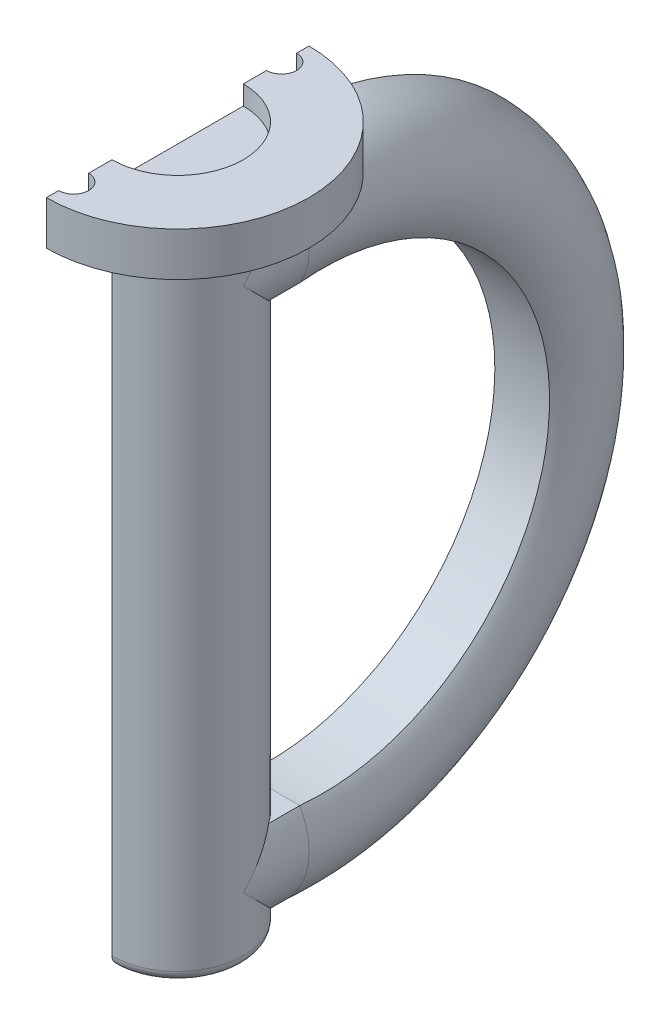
ISO-10303-21;
HEADER;
FILE_DESCRIPTION(('STEP AP214'),'2;1');
FILE_NAME('part.step','',(''),(''),'','','');
FILE_SCHEMA(('AUTOMOTIVE_DESIGN { 1 0 10303 214 1 1 1 1 }'));
ENDSEC;
DATA;
#1=APPLICATION_CONTEXT('core data for automotive mechanical design processes');
#2=APPLICATION_PROTOCOL_DEFINITION('international standard','automotive_design',2000,#1);
#3=PRODUCT_CONTEXT('',#1,'mechanical');
#4=PRODUCT('Part','Part','',(#3));
#5=PRODUCT_RELATED_PRODUCT_CATEGORY('part','',(#4));
#6=PRODUCT_DEFINITION_FORMATION('','',#4);
#7=PRODUCT_DEFINITION_CONTEXT('part definition',#1,'design');
#8=PRODUCT_DEFINITION('design','',#6,#7);
#9=PRODUCT_DEFINITION_SHAPE('','',#8);
#10=(LENGTH_UNIT() NAMED_UNIT(*) SI_UNIT(.MILLI.,.METRE.));
#11=(NAMED_UNIT(*) PLANE_ANGLE_UNIT() SI_UNIT($,.RADIAN.));
#12=(NAMED_UNIT(*) SI_UNIT($,.STERADIAN.) SOLID_ANGLE_UNIT());
#13=UNCERTAINTY_MEASURE_WITH_UNIT(LENGTH_MEASURE(1.E-05),#10,'distance_accuracy_value','');
#14=(GEOMETRIC_REPRESENTATION_CONTEXT(3) GLOBAL_UNCERTAINTY_ASSIGNED_CONTEXT((#13)) GLOBAL_UNIT_ASSIGNED_CONTEXT((#10,
#11,#12)) REPRESENTATION_CONTEXT('',''));
#15=CARTESIAN_POINT('',(0.,0.,0.));
#16=DIRECTION('',(0.,0.,1.));
#17=DIRECTION('',(1.,0.,0.));
#18=AXIS2_PLACEMENT_3D('',#15,#16,#17);
#19=CARTESIAN_POINT('',(0.,0.,0.));
#20=DIRECTION('',(0.,1.,0.));
#21=DIRECTION('',(0.,0.,1.));
#22=AXIS2_PLACEMENT_3D('',#19,#20,#21);
#23=PLANE('',#22);
#24=CARTESIAN_POINT('',(0.,0.,0.));
#25=DIRECTION('',(0.,1.,0.));
#26=DIRECTION('',(0.,0.,1.));
#27=AXIS2_PLACEMENT_3D('',#24,#25,#26);
#28=CIRCLE('',#27,24.);
#29=CARTESIAN_POINT('',(0.,0.,24.));
#30=VERTEX_POINT('',#29);
#31=CARTESIAN_POINT('',(0.,0.,-24.));
#32=VERTEX_POINT('',#31);
#33=EDGE_CURVE('E395',#30,#32,#28,.T.);
#34=ORIENTED_EDGE('',*,*,#33,.F.);
#35=DIRECTION('',(0.,0.,-1.));
#36=VECTOR('',#35,1.);
#37=CARTESIAN_POINT('',(0.,0.,0.));
#38=LINE('',#37,#36);
#39=CARTESIAN_POINT('',(0.,0.,12.));
#40=VERTEX_POINT('',#39);
#41=EDGE_CURVE('E415',#30,#40,#38,.T.);
#42=ORIENTED_EDGE('',*,*,#41,.T.);
#43=CARTESIAN_POINT('',(0.,0.,0.));
#44=DIRECTION('',(0.,1.,0.));
#45=DIRECTION('',(0.,0.,1.));
#46=AXIS2_PLACEMENT_3D('',#43,#44,#45);
#47=CIRCLE('',#46,12.);
#48=CARTESIAN_POINT('',(1.02303343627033,0.,-11.9563122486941));
#49=VERTEX_POINT('',#48);
#50=EDGE_CURVE('E410',#49,#40,#47,.F.);
#51=ORIENTED_EDGE('',*,*,#50,.F.);
#52=CARTESIAN_POINT('',(0.,0.,-11.4508895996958));
#53=CARTESIAN_POINT('',(-0.0676941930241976,0.,-11.4508888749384));
#54=CARTESIAN_POINT('',(-0.135386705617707,0.,-11.4572236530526));
#55=CARTESIAN_POINT('',(-0.268564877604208,0.,-11.481855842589));
#56=CARTESIAN_POINT('',(-0.334048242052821,0.,-11.500165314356));
#57=CARTESIAN_POINT('',(-0.474643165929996,0.,-11.5520036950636));
#58=CARTESIAN_POINT('',(-0.548856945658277,0.,-11.5879345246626));
#59=CARTESIAN_POINT('',(-0.690599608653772,0.,-11.671337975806));
#60=CARTESIAN_POINT('',(-0.758106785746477,0.,-11.7188464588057));
#61=CARTESIAN_POINT('',(-0.872174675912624,0.,-11.8108932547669));
#62=CARTESIAN_POINT('',(-0.920083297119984,0.,-11.8538000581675));
#63=CARTESIAN_POINT('',(-1.01189568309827,0.,-11.9435520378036));
#64=CARTESIAN_POINT('',(-1.0558052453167,0.,-11.9903913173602));
#65=CARTESIAN_POINT('',(-1.14010896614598,0.,-12.0873271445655));
#66=CARTESIAN_POINT('',(-1.18049347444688,0.,-12.1374320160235));
#67=CARTESIAN_POINT('',(-1.25794595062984,0.,-12.2401581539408));
#68=CARTESIAN_POINT('',(-1.29501244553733,0.,-12.2927805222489));
#69=CARTESIAN_POINT('',(-1.39755974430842,-1.29790876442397E-13,-12.4474467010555));
#70=CARTESIAN_POINT('',(-1.45918865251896,0.,-12.552051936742));
#71=CARTESIAN_POINT('',(-1.57338713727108,0.,-12.7660883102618));
#72=CARTESIAN_POINT('',(-1.6259501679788,0.,-12.8755228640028));
#73=CARTESIAN_POINT('',(-1.72337270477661,0.,-13.097998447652));
#74=CARTESIAN_POINT('',(-1.7682168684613,0.,-13.2110461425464));
#75=CARTESIAN_POINT('',(-1.85105383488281,0.,-13.4395719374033));
#76=CARTESIAN_POINT('',(-1.8890480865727,0.,-13.5550495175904));
#77=CARTESIAN_POINT('',(-1.95861273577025,0.,-13.7866763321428));
#78=CARTESIAN_POINT('',(-1.99024252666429,0.,-13.9028078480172));
#79=CARTESIAN_POINT('',(-2.0481028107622,0.,-14.1364159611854));
#80=CARTESIAN_POINT('',(-2.0743323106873,0.,-14.2538928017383));
#81=CARTESIAN_POINT('',(-2.14562609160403,0.,-14.6079761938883));
#82=CARTESIAN_POINT('',(-2.18325696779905,0.,-14.8461023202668));
#83=CARTESIAN_POINT('',(-2.24110543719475,0.,-15.3248585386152));
#84=CARTESIAN_POINT('',(-2.26128788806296,0.,-15.5654927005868));
#85=CARTESIAN_POINT('',(-2.28535197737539,0.,-16.0474590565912));
#86=CARTESIAN_POINT('',(-2.2892408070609,0.,-16.2887908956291));
#87=CARTESIAN_POINT('',(-2.28080066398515,0.,-16.7923937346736));
#88=CARTESIAN_POINT('',(-2.26701590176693,0.,-17.0546404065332));
#89=CARTESIAN_POINT('',(-2.22015841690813,0.,-17.5776770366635));
#90=CARTESIAN_POINT('',(-2.18707082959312,0.,-17.8384657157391));
#91=CARTESIAN_POINT('',(-2.12158774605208,0.,-18.2271262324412));
#92=CARTESIAN_POINT('',(-2.09709316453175,0.,-18.356357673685));
#93=CARTESIAN_POINT('',(-2.04241266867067,0.,-18.6136036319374));
#94=CARTESIAN_POINT('',(-2.01222766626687,0.,-18.7416183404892));
#95=CARTESIAN_POINT('',(-1.94568866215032,0.,-18.9958654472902));
#96=CARTESIAN_POINT('',(-1.90934278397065,0.,-19.1220999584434));
#97=CARTESIAN_POINT('',(-1.8297535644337,0.,-19.3723514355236));
#98=CARTESIAN_POINT('',(-1.78651239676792,0.,-19.4963690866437));
#99=CARTESIAN_POINT('',(-1.69354693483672,0.,-19.737778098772));
#100=CARTESIAN_POINT('',(-1.64405229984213,0.,-19.8552569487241));
#101=CARTESIAN_POINT('',(-1.53637894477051,0.,-20.0863417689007));
#102=CARTESIAN_POINT('',(-1.47819182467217,0.,-20.1999438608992));
#103=CARTESIAN_POINT('',(-1.35204522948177,0.,-20.4203708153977));
#104=CARTESIAN_POINT('',(-1.28417997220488,0.,-20.5272481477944));
#105=CARTESIAN_POINT('',(-1.1732323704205,0.,-20.6808016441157));
#106=CARTESIAN_POINT('',(-1.13476129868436,0.,-20.7308195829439));
#107=CARTESIAN_POINT('',(-1.05442529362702,0.,-20.8280359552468));
#108=CARTESIAN_POINT('',(-1.01256241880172,0.,-20.8752360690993));
#109=CARTESIAN_POINT('',(-0.937895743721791,0.,-20.95276128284));
#110=CARTESIAN_POINT('',(-0.90602370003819,0.,-20.9839841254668));
#111=CARTESIAN_POINT('',(-0.84030397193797,0.,-21.0442652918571));
#112=CARTESIAN_POINT('',(-0.806457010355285,0.,-21.0733243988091));
#113=CARTESIAN_POINT('',(-0.736751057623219,0.,-21.1288025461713));
#114=CARTESIAN_POINT('',(-0.700895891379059,0.,-21.155226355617));
#115=CARTESIAN_POINT('',(-0.627044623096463,0.,-21.2049991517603));
#116=CARTESIAN_POINT('',(-0.589045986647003,0.,-21.2283443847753));
#117=CARTESIAN_POINT('',(-0.493066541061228,0.,-21.2811804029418));
#118=CARTESIAN_POINT('',(-0.433904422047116,0.,-21.3085890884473));
#119=CARTESIAN_POINT('',(-0.311964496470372,0.,-21.3534080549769));
#120=CARTESIAN_POINT('',(-0.249193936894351,0.,-21.3708376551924));
#121=CARTESIAN_POINT('',(-0.120964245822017,0.,-21.3941118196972));
#122=CARTESIAN_POINT('',(-0.0554877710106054,0.,-21.3998636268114));
#123=CARTESIAN_POINT('',(0.0753601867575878,0.,-21.3988008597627));
#124=CARTESIAN_POINT('',(0.140731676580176,0.,-21.3919871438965));
#125=CARTESIAN_POINT('',(0.262447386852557,0.,-21.3679556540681));
#126=CARTESIAN_POINT('',(0.31902697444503,0.,-21.3518842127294));
#127=CARTESIAN_POINT('',(0.42926648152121,0.,-21.3116180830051));
#128=CARTESIAN_POINT('',(0.482921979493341,0.,-21.2874114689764));
#129=CARTESIAN_POINT('',(0.575708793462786,0.,-21.2382129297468));
#130=CARTESIAN_POINT('',(0.615515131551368,0.,-21.2144654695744));
#131=CARTESIAN_POINT('',(0.692826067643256,0.,-21.1635686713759));
#132=CARTESIAN_POINT('',(0.730332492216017,0.,-21.1364220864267));
#133=CARTESIAN_POINT('',(0.839713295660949,0.,-21.0505937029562));
#134=CARTESIAN_POINT('',(0.908247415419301,0.,-20.987636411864));
#135=CARTESIAN_POINT('',(1.02915740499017,0.,-20.8623747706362));
#136=CARTESIAN_POINT('',(1.08248314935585,0.,-20.8009569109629));
#137=CARTESIAN_POINT('',(1.18370335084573,0.,-20.6737496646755));
#138=CARTESIAN_POINT('',(1.23159399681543,0.,-20.6079572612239));
#139=CARTESIAN_POINT('',(1.32261461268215,0.,-20.4730558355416));
#140=CARTESIAN_POINT('',(1.3657376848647,2.39002855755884E-13,-20.403942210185));
#141=CARTESIAN_POINT('',(1.44773115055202,-2.39091390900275E-13,-20.2632187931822));
#142=CARTESIAN_POINT('',(1.48659996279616,-8.9256801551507E-13,-20.1916080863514));
#143=CARTESIAN_POINT('',(1.56145627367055,-9.14487297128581E-13,-20.0446513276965));
#144=CARTESIAN_POINT('',(1.59734782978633,-2.50500438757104E-13,-19.9692566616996));
#145=CARTESIAN_POINT('',(1.66554939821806,2.50552331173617E-13,-19.8168578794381));
#146=CARTESIAN_POINT('',(1.69785866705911,0.,-19.7398534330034));
#147=CARTESIAN_POINT('',(1.78996822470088,-1.7500024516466E-13,-19.5068149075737));
#148=CARTESIAN_POINT('',(1.8449050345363,0.,-19.3488470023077));
#149=CARTESIAN_POINT('',(1.94392596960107,0.,-19.0290902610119));
#150=CARTESIAN_POINT('',(1.98797622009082,0.,-18.8672911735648));
#151=CARTESIAN_POINT('',(2.06633448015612,0.,-18.5414196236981));
#152=CARTESIAN_POINT('',(2.10064549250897,0.,-18.3773478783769));
#153=CARTESIAN_POINT('',(2.15682665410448,0.,-18.0675507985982));
#154=CARTESIAN_POINT('',(2.17969922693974,0.,-17.9220047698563));
#155=CARTESIAN_POINT('',(2.21902766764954,0.,-17.630040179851));
#156=CARTESIAN_POINT('',(2.2354827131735,0.,-17.4836215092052));
#157=CARTESIAN_POINT('',(2.27566763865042,0.,-17.0433095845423));
#158=CARTESIAN_POINT('',(2.29018611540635,0.,-16.7485373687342));
#159=CARTESIAN_POINT('',(2.29539987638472,0.,-16.1596804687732));
#160=CARTESIAN_POINT('',(2.28616803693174,0.,-15.865596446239));
#161=CARTESIAN_POINT('',(2.25379149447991,0.,-15.4260106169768));
#162=CARTESIAN_POINT('',(2.23991887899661,0.,-15.2797871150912));
#163=CARTESIAN_POINT('',(2.2056822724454,0.,-14.9881109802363));
#164=CARTESIAN_POINT('',(2.18531945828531,0.,-14.8426582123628));
#165=CARTESIAN_POINT('',(2.14379099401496,0.,-14.5901609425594));
#166=CARTESIAN_POINT('',(2.12417869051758,0.,-14.4828592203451));
#167=CARTESIAN_POINT('',(2.0808806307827,0.,-14.2690828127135));
#168=CARTESIAN_POINT('',(2.05719516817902,0.,-14.1626080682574));
#169=CARTESIAN_POINT('',(2.0054041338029,0.,-13.9505871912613));
#170=CARTESIAN_POINT('',(1.97729286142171,0.,-13.8450424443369));
#171=CARTESIAN_POINT('',(1.91627365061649,0.,-13.6353439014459));
#172=CARTESIAN_POINT('',(1.88336586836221,-2.67926941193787E-13,-13.5311900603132));
#173=CARTESIAN_POINT('',(1.81195278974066,-2.69814189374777E-13,-13.3238477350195));
#174=CARTESIAN_POINT('',(1.77340369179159,0.,-13.2206742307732));
#175=CARTESIAN_POINT('',(1.69023367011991,0.,-13.0167434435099));
#176=CARTESIAN_POINT('',(1.6456107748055,0.,-12.9159869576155));
#177=CARTESIAN_POINT('',(1.54960330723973,0.,-12.7181182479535));
#178=CARTESIAN_POINT('',(1.49824096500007,0.,-12.620995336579));
#179=CARTESIAN_POINT('',(1.3876043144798,0.,-12.431415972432));
#180=CARTESIAN_POINT('',(1.3283375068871,0.,-12.3389552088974));
#181=CARTESIAN_POINT('',(1.20923901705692,0.,-12.1728029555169));
#182=CARTESIAN_POINT('',(1.15058952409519,0.,-12.0982725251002));
#183=CARTESIAN_POINT('',(1.02526052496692,0.,-11.9560238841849));
#184=CARTESIAN_POINT('',(0.958572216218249,0.,-11.8883132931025));
#185=CARTESIAN_POINT('',(0.815363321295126,0.,-11.7620066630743));
#186=CARTESIAN_POINT('',(0.738728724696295,0.,-11.7035371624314));
#187=CARTESIAN_POINT('',(0.576073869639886,0.,-11.6015230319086));
#188=CARTESIAN_POINT('',(0.490084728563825,-1.37397542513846E-13,-11.5579308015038));
#189=CARTESIAN_POINT('',(0.336300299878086,-1.03074652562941E-13,-11.5008327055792));
#190=CARTESIAN_POINT('',(0.270392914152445,0.,-11.4822784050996));
#191=CARTESIAN_POINT('',(0.136321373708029,0.,-11.4573140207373));
#192=CARTESIAN_POINT('',(0.0681598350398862,0.,-11.4508903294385));
#193=CARTESIAN_POINT('',(0.,0.,-11.4508895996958));
#194=B_SPLINE_CURVE_WITH_KNOTS('',3,(#52,#53,#54,#55,#56,#57,#58,#59,#60,#61,#62,#63,#64,#65,
#66,#67,#68,#69,#70,#71,#72,#73,#74,#75,#76,#77,#78,#79,#80,#81,#82,#83,#84,#85,#86,#87,#88,#89,
#90,#91,#92,#93,#94,#95,#96,#97,#98,#99,#100,#101,#102,#103,#104,#105,#106,#107,#108,#109,#110,
#111,#112,#113,#114,#115,#116,#117,#118,#119,#120,#121,#122,#123,#124,#125,#126,#127,#128,#129,
#130,#131,#132,#133,#134,#135,#136,#137,#138,#139,#140,#141,#142,#143,#144,#145,#146,#147,#148,
#149,#150,#151,#152,#153,#154,#155,#156,#157,#158,#159,#160,#161,#162,#163,#164,#165,#166,#167,
#168,#169,#170,#171,#172,#173,#174,#175,#176,#177,#178,#179,#180,#181,#182,#183,#184,#185,#186,
#187,#188,#189,#190,#191,#192,#193),.UNSPECIFIED.,.T.,.F.,(4,2,2,2,2,2,2,2,2,2,2,2,2,2,2,2,2,2,
2,2,2,2,2,2,2,2,2,2,2,2,2,2,2,2,2,2,2,2,2,2,2,2,2,2,2,2,2,2,2,2,2,2,2,2,2,2,2,2,2,2,2,2,2,2,2,2,
2,2,2,2,4),(0.,0.202801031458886,0.405806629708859,0.651803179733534,0.898571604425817,
1.09125042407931,1.28364531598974,1.47655139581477,1.66954269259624,2.03316070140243,
2.39704016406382,2.76163474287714,3.1261521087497,3.4870915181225,3.84809725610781,
4.57052371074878,5.29440181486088,6.01796039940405,6.80512825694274,7.59290309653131,
7.9873973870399,8.38182851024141,8.77574353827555,9.16953463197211,9.551675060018,
9.93418718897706,10.3132018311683,10.5023892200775,10.6914626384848,10.8252332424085,
10.958955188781,11.0924305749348,11.2260672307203,11.4209074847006,11.6153692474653,
11.8113696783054,12.0073567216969,12.1831168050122,12.3591356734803,12.4979975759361,
12.6367477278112,12.9149337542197,13.1586354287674,13.4025069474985,13.6467268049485,
13.8910371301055,14.1414357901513,14.3918863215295,14.8930921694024,15.395838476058,
15.8984296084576,16.3402767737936,16.7821805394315,17.6665253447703,18.5481598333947,
18.9886839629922,19.4291282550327,19.7562973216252,20.0834428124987,20.4110131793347,
20.7385728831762,21.0688260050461,21.3991865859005,21.7284836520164,22.0574704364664,
22.3415346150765,22.6259127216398,22.9138988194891,23.2009546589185,23.4053801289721,
23.6095761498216),.UNSPECIFIED.);
#195=CARTESIAN_POINT('',(0.,0.,-21.3993650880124));
#196=VERTEX_POINT('',#195);
#197=EDGE_CURVE('E390',#196,#49,#194,.T.);
#198=ORIENTED_EDGE('',*,*,#197,.F.);
#199=EDGE_CURVE('E417',#196,#32,#38,.T.);
#200=ORIENTED_EDGE('',*,*,#199,.T.);
#201=EDGE_LOOP('',(#34,#42,#51,#198,#200));
#202=FACE_BOUND('',#201,.T.);
#203=ADVANCED_FACE('F39',(#202),#23,.F.);
#204=CARTESIAN_POINT('',(0.,-120.,0.));
#205=DIRECTION('',(0.,1.,0.));
#206=DIRECTION('',(-1.,0.,0.));
#207=AXIS2_PLACEMENT_3D('',#204,#205,#206);
#208=PLANE('',#207);
#209=DIRECTION('',(0.,0.,1.));
#210=VECTOR('',#209,1.);
#211=CARTESIAN_POINT('',(0.,-120.,0.));
#212=LINE('',#211,#210);
#213=CARTESIAN_POINT('',(0.,-120.,-10.));
#214=VERTEX_POINT('',#213);
#215=CARTESIAN_POINT('',(0.,-120.,10.));
#216=VERTEX_POINT('',#215);
#217=EDGE_CURVE('E259',#214,#216,#212,.T.);
#218=ORIENTED_EDGE('',*,*,#217,.F.);
#219=CARTESIAN_POINT('',(0.,-120.,0.));
#220=DIRECTION('',(0.,1.,0.));
#221=DIRECTION('',(-1.,0.,0.));
#222=AXIS2_PLACEMENT_3D('',#219,#220,#221);
#223=CIRCLE('',#222,10.);
#224=EDGE_CURVE('E452',#214,#216,#223,.F.);
#225=ORIENTED_EDGE('',*,*,#224,.T.);
#226=EDGE_LOOP('',(#218,#225));
#227=FACE_BOUND('',#226,.T.);
#228=ADVANCED_FACE('F344',(#227),#208,.F.);
#229=CARTESIAN_POINT('',(0.,0.,0.));
#230=DIRECTION('',(0.,1.,0.));
#231=DIRECTION('',(-1.,0.,0.));
#232=AXIS2_PLACEMENT_3D('',#229,#230,#231);
#233=CYLINDRICAL_SURFACE('',#232,12.);
#234=DIRECTION('',(0.,1.,0.));
#235=VECTOR('',#234,1.);
#236=CARTESIAN_POINT('',(0.,0.,12.));
#237=LINE('',#236,#235);
#238=CARTESIAN_POINT('',(0.,-118.,12.));
#239=VERTEX_POINT('',#238);
#240=EDGE_CURVE('E422',#40,#239,#237,.F.);
#241=ORIENTED_EDGE('',*,*,#240,.T.);
#242=CARTESIAN_POINT('',(0.,-118.,0.));
#243=DIRECTION('',(0.,1.,0.));
#244=DIRECTION('',(-1.,0.,0.));
#245=AXIS2_PLACEMENT_3D('',#242,#243,#244);
#246=CIRCLE('',#245,12.);
#247=CARTESIAN_POINT('',(6.63324958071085,-118.,-10.));
#248=VERTEX_POINT('',#247);
#249=EDGE_CURVE('E309',#239,#248,#246,.T.);
#250=ORIENTED_EDGE('',*,*,#249,.T.);
#251=CARTESIAN_POINT('',(3.51088027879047,-119.474916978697,-11.4749169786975));
#252=CARTESIAN_POINT('',(3.66628710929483,-119.427370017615,-11.4273700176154));
#253=CARTESIAN_POINT('',(3.81987538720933,-119.376923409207,-11.376923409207));
#254=CARTESIAN_POINT('',(4.12316492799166,-119.27055129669,-11.27055129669));
#255=CARTESIAN_POINT('',(4.27286714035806,-119.214627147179,-11.2146271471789));
#256=CARTESIAN_POINT('',(4.71525136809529,-119.039331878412,-11.0393318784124));
#257=CARTESIAN_POINT('',(5.00187805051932,-118.912231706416,-10.9122317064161));
#258=CARTESIAN_POINT('',(5.55428771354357,-118.641593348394,-10.641593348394));
#259=CARTESIAN_POINT('',(5.82026698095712,-118.498253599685,-10.4982535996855));
#260=CARTESIAN_POINT('',(6.33443336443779,-118.196268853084,-10.1962688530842));
#261=CARTESIAN_POINT('',(6.58260964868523,-118.037614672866,-10.0376146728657));
#262=CARTESIAN_POINT('',(7.12000327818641,-117.666282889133,-9.66628288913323));
#263=CARTESIAN_POINT('',(7.40417445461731,-117.449953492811,-9.44995349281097));
#264=CARTESIAN_POINT('',(7.94445366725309,-117.000510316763,-9.00051031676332));
#265=CARTESIAN_POINT('',(8.20055860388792,-116.767394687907,-8.76739468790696));
#266=CARTESIAN_POINT('',(8.68666784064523,-116.286097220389,-8.2860972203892));
#267=CARTESIAN_POINT('',(8.91652528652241,-116.037841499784,-8.0378414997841));
#268=CARTESIAN_POINT('',(9.34940271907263,-115.529941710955,-7.52994171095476));
#269=CARTESIAN_POINT('',(9.55242074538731,-115.270296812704,-7.27029681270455));
#270=CARTESIAN_POINT('',(10.0094988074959,-114.63469120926,-6.63469120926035));
#271=CARTESIAN_POINT('',(10.2509639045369,-114.254183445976,-6.25418344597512));
#272=CARTESIAN_POINT('',(10.6851715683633,-113.479453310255,-5.47945331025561));
#273=CARTESIAN_POINT('',(10.8778911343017,-113.085224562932,-5.08522456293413));
#274=CARTESIAN_POINT('',(11.2163002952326,-112.287432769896,-4.28743276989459));
#275=CARTESIAN_POINT('',(11.3620530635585,-111.883883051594,-3.88388305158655));
#276=CARTESIAN_POINT('',(11.6083890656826,-111.070165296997,-3.07016529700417));
#277=CARTESIAN_POINT('',(11.7089923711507,-110.660000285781,-2.66000028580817));
#278=CARTESIAN_POINT('',(11.8581631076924,-109.877733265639,-1.87773326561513));
#279=CARTESIAN_POINT('',(11.911001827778,-109.506031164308,-1.5060311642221));
#280=CARTESIAN_POINT('',(11.9816538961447,-108.761346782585,-0.761346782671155));
#281=CARTESIAN_POINT('',(11.9995087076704,-108.388366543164,-0.388366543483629));
#282=CARTESIAN_POINT('',(11.9999966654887,-108.010327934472,-0.0103279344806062));
#283=CARTESIAN_POINT('',(11.9999999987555,-108.005163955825,-0.00516395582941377));
#284=CARTESIAN_POINT('',(12.,-108.,0.));
#285=B_SPLINE_CURVE_WITH_KNOTS('',3,(#251,#252,#253,#254,#255,#256,#257,#258,#259,#260,#261,
#262,#263,#264,#265,#266,#267,#268,#269,#270,#271,#272,#273,#274,#275,#276,#277,#278,#279,#280,
#281,#282,#283,#284),.UNSPECIFIED.,.F.,.F.,(4,2,2,2,2,2,2,2,2,2,2,2,2,2,2,2,4),(0.,
0.507859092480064,1.01559290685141,2.02888638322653,3.0309157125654,4.03354962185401,
5.28435359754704,6.53529557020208,7.79292511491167,9.05064646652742,10.8173779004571,
12.5849414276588,14.3501174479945,16.1145079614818,17.6983529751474,19.2803196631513,
19.3022285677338),.UNSPECIFIED.);
#286=CARTESIAN_POINT('',(12.,-108.,0.));
#287=VERTEX_POINT('',#286);
#288=EDGE_CURVE('E357',#287,#248,#285,.F.);
#289=ORIENTED_EDGE('',*,*,#288,.F.);
#290=CARTESIAN_POINT('',(10.,-101.366750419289,-6.63324958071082));
#291=CARTESIAN_POINT('',(10.1079076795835,-101.529437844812,-6.47056215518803));
#292=CARTESIAN_POINT('',(10.2111253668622,-101.693651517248,-6.30634848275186));
#293=CARTESIAN_POINT('',(10.4083660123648,-102.024794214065,-5.97520578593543));
#294=CARTESIAN_POINT('',(10.5023901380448,-102.191722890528,-5.80827710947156));
#295=CARTESIAN_POINT('',(10.7708864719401,-102.695945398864,-5.3040546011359));
#296=CARTESIAN_POINT('',(10.9319061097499,-103.036863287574,-4.96313671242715));
#297=CARTESIAN_POINT('',(11.2188736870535,-103.725011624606,-4.27498837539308));
#298=CARTESIAN_POINT('',(11.3449072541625,-104.072224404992,-3.92777559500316));
#299=CARTESIAN_POINT('',(11.5634475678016,-104.771849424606,-3.22815057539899));
#300=CARTESIAN_POINT('',(11.6559561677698,-105.124261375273,-2.87573862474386));
#301=CARTESIAN_POINT('',(11.8211989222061,-105.893065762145,-2.10693423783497));
#302=CARTESIAN_POINT('',(11.8878618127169,-106.310110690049,-1.68988930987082));
#303=CARTESIAN_POINT('',(11.9769715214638,-107.146322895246,-0.853677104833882));
#304=CARTESIAN_POINT('',(11.9994491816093,-107.565488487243,-0.434511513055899));
#305=CARTESIAN_POINT('',(11.9999966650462,-107.989672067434,-0.010327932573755));
#306=CARTESIAN_POINT('',(11.999999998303,-107.99483604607,-0.00516395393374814));
#307=CARTESIAN_POINT('',(12.,-108.,0.));
#308=B_SPLINE_CURVE_WITH_KNOTS('',3,(#290,#291,#292,#293,#294,#295,#296,#297,#298,#299,#300,
#301,#302,#303,#304,#305,#306,#307),.UNSPECIFIED.,.F.,.F.,(4,2,2,2,2,2,2,2,4),(0.,
0.762250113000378,1.52440330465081,3.04783422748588,4.56750303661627,6.08708781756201,
7.86607179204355,9.64381356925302,9.66572247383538),.UNSPECIFIED.);
#309=CARTESIAN_POINT('',(10.,-101.366750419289,-6.63324958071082));
#310=VERTEX_POINT('',#309);
#311=EDGE_CURVE('E351',#310,#287,#308,.T.);
#312=ORIENTED_EDGE('',*,*,#311,.F.);
#313=CARTESIAN_POINT('',(0.,-101.366750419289,0.));
#314=DIRECTION('',(0.,-1.,0.));
#315=DIRECTION('',(0.,0.,-1.));
#316=AXIS2_PLACEMENT_3D('',#313,#314,#315);
#317=CIRCLE('',#316,12.);
#318=CARTESIAN_POINT('',(0.,-101.366750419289,-12.));
#319=VERTEX_POINT('',#318);
#320=EDGE_CURVE('E358',#319,#310,#317,.T.);
#321=ORIENTED_EDGE('',*,*,#320,.F.);
#322=DIRECTION('',(0.,1.,0.));
#323=VECTOR('',#322,1.);
#324=CARTESIAN_POINT('',(0.,0.,-12.));
#325=LINE('',#324,#323);
#326=CARTESIAN_POINT('',(0.,-18.6332495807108,-12.));
#327=VERTEX_POINT('',#326);
#328=EDGE_CURVE('E272',#319,#327,#325,.T.);
#329=ORIENTED_EDGE('',*,*,#328,.T.);
#330=CARTESIAN_POINT('',(0.,-18.6332495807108,0.));
#331=DIRECTION('',(0.,-1.,0.));
#332=DIRECTION('',(0.,0.,-1.));
#333=AXIS2_PLACEMENT_3D('',#330,#331,#332);
#334=CIRCLE('',#333,12.);
#335=CARTESIAN_POINT('',(10.,-18.6332495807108,-6.63324958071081));
#336=VERTEX_POINT('',#335);
#337=EDGE_CURVE('E336',#327,#336,#334,.T.);
#338=ORIENTED_EDGE('',*,*,#337,.T.);
#339=CARTESIAN_POINT('',(0.,-12.,0.));
#340=DIRECTION('',(0.,0.707106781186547,-0.707106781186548));
#341=DIRECTION('',(0.,0.707106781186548,0.707106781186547));
#342=AXIS2_PLACEMENT_3D('',#339,#340,#341);
#343=ELLIPSE('',#342,16.9705627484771,12.);
#344=CARTESIAN_POINT('',(12.,-12.,0.));
#345=VERTEX_POINT('',#344);
#346=EDGE_CURVE('E365',#336,#345,#343,.F.);
#347=ORIENTED_EDGE('',*,*,#346,.T.);
#348=CARTESIAN_POINT('',(0.,-12.,0.));
#349=DIRECTION('',(0.,0.707106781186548,0.707106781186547));
#350=DIRECTION('',(0.,0.707106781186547,-0.707106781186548));
#351=AXIS2_PLACEMENT_3D('',#348,#349,#350);
#352=ELLIPSE('',#351,16.9705627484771,12.);
#353=CARTESIAN_POINT('',(3.51088027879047,-0.525083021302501,-11.4749169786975));
#354=VERTEX_POINT('',#353);
#355=EDGE_CURVE('E335',#345,#354,#352,.T.);
#356=ORIENTED_EDGE('',*,*,#355,.T.);
#357=CARTESIAN_POINT('',(1.02303343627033,0.,-11.9563122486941));
#358=CARTESIAN_POINT('',(1.10941671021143,-0.00802292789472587,-11.9489217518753));
#359=CARTESIAN_POINT('',(1.19562578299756,-0.0170567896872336,-11.9406015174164));
#360=CARTESIAN_POINT('',(1.36729489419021,-0.037085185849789,-11.9221610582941));
#361=CARTESIAN_POINT('',(1.4527565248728,-0.0480723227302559,-11.9120476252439));
#362=CARTESIAN_POINT('',(1.62293995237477,-0.0719733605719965,-11.8900550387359));
#363=CARTESIAN_POINT('',(1.707663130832,-0.0848819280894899,-11.8781807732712));
#364=CARTESIAN_POINT('',(1.87637874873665,-0.112594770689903,-11.8526987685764));
#365=CARTESIAN_POINT('',(1.96037221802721,-0.127395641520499,-11.839094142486));
#366=CARTESIAN_POINT('',(2.12763649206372,-0.158866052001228,-11.8101803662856));
#367=CARTESIAN_POINT('',(2.210907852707,-0.175533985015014,-11.7948726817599));
#368=CARTESIAN_POINT('',(2.37671763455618,-0.210711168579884,-11.7625824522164));
#369=CARTESIAN_POINT('',(2.45925618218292,-0.229220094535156,-11.7456002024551));
#370=CARTESIAN_POINT('',(2.62363030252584,-0.26806326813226,-11.7099804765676));
#371=CARTESIAN_POINT('',(2.70546512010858,-0.288399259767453,-11.6913414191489));
#372=CARTESIAN_POINT('',(2.86844113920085,-0.330880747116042,-11.6524279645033));
#373=CARTESIAN_POINT('',(2.94958078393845,-0.353029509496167,-11.6321506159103));
#374=CARTESIAN_POINT('',(3.11117412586,-0.399124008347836,-11.5899778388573));
#375=CARTESIAN_POINT('',(3.19162539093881,-0.423074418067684,-11.5680782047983));
#376=CARTESIAN_POINT('',(3.35184957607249,-0.472762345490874,-11.5226761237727));
#377=CARTESIAN_POINT('',(3.43161912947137,-0.498505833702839,-11.499168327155));
#378=CARTESIAN_POINT('',(3.51088027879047,-0.525083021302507,-11.4749169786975));
#379=B_SPLINE_CURVE_WITH_KNOTS('',3,(#357,#358,#359,#360,#361,#362,#363,#364,#365,#366,#367,
#368,#369,#370,#371,#372,#373,#374,#375,#376,#377,#378),.UNSPECIFIED.,.F.,.F.,(4,2,2,2,2,2,2,2,
2,2,4),(0.,0.261195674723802,0.521422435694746,0.780939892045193,1.03999687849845,
1.29883263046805,1.55762282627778,1.81666272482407,2.07618015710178,2.33639563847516,
2.59752332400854),.UNSPECIFIED.);
#380=EDGE_CURVE('E327',#49,#354,#379,.T.);
#381=ORIENTED_EDGE('',*,*,#380,.F.);
#382=ORIENTED_EDGE('',*,*,#50,.T.);
#383=EDGE_LOOP('',(#241,#250,#289,#312,#321,#329,#338,#347,#356,#381,#382));
#384=FACE_BOUND('',#383,.T.);
#385=ADVANCED_FACE('F338',(#384),#233,.T.);
#386=CARTESIAN_POINT('',(0.,8.,0.));
#387=DIRECTION('',(0.,-1.,0.));
#388=DIRECTION('',(0.,0.,-1.));
#389=AXIS2_PLACEMENT_3D('',#386,#387,#388);
#390=CYLINDRICAL_SURFACE('',#389,24.);
#391=CARTESIAN_POINT('',(0.,8.,0.));
#392=DIRECTION('',(0.,1.,0.));
#393=DIRECTION('',(0.,0.,1.));
#394=AXIS2_PLACEMENT_3D('',#391,#392,#393);
#395=CIRCLE('',#394,24.);
#396=CARTESIAN_POINT('',(0.,8.00000000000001,24.));
#397=VERTEX_POINT('',#396);
#398=CARTESIAN_POINT('',(0.,8.00000000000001,-24.));
#399=VERTEX_POINT('',#398);
#400=EDGE_CURVE('E396',#397,#399,#395,.T.);
#401=ORIENTED_EDGE('',*,*,#400,.F.);
#402=DIRECTION('',(0.,-1.,0.));
#403=VECTOR('',#402,1.);
#404=CARTESIAN_POINT('',(0.,8.,24.));
#405=LINE('',#404,#403);
#406=EDGE_CURVE('E252',#397,#30,#405,.T.);
#407=ORIENTED_EDGE('',*,*,#406,.T.);
#408=ORIENTED_EDGE('',*,*,#33,.T.);
#409=DIRECTION('',(0.,-1.,0.));
#410=VECTOR('',#409,1.);
#411=CARTESIAN_POINT('',(0.,8.,-24.));
#412=LINE('',#411,#410);
#413=EDGE_CURVE('E409',#32,#399,#412,.F.);
#414=ORIENTED_EDGE('',*,*,#413,.T.);
#415=EDGE_LOOP('',(#401,#407,#408,#414));
#416=FACE_BOUND('',#415,.T.);
#417=ADVANCED_FACE('F343',(#416),#390,.T.);
#418=CARTESIAN_POINT('',(0.,8.,0.));
#419=DIRECTION('',(0.,1.,0.));
#420=DIRECTION('',(0.,0.,1.));
#421=AXIS2_PLACEMENT_3D('',#418,#419,#420);
#422=PLANE('',#421);
#423=CARTESIAN_POINT('',(0.,8.,19.));
#424=DIRECTION('',(0.,1.,0.));
#425=DIRECTION('',(0.,0.,1.));
#426=AXIS2_PLACEMENT_3D('',#423,#424,#425);
#427=CIRCLE('',#426,2.75);
#428=CARTESIAN_POINT('',(0.,8.,21.75));
#429=VERTEX_POINT('',#428);
#430=CARTESIAN_POINT('',(0.,8.,16.25));
#431=VERTEX_POINT('',#430);
#432=EDGE_CURVE('E235',#429,#431,#427,.T.);
#433=ORIENTED_EDGE('',*,*,#432,.F.);
#434=DIRECTION('',(0.,0.,1.));
#435=VECTOR('',#434,1.);
#436=CARTESIAN_POINT('',(0.,8.00000000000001,36.1347435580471));
#437=LINE('',#436,#435);
#438=EDGE_CURVE('E244',#429,#397,#437,.T.);
#439=ORIENTED_EDGE('',*,*,#438,.T.);
#440=ORIENTED_EDGE('',*,*,#400,.T.);
#441=CARTESIAN_POINT('',(0.,8.,-21.75));
#442=VERTEX_POINT('',#441);
#443=EDGE_CURVE('E257',#399,#442,#437,.T.);
#444=ORIENTED_EDGE('',*,*,#443,.T.);
#445=CARTESIAN_POINT('',(0.,8.,-19.));
#446=DIRECTION('',(0.,1.,0.));
#447=DIRECTION('',(0.,0.,1.));
#448=AXIS2_PLACEMENT_3D('',#445,#446,#447);
#449=CIRCLE('',#448,2.75);
#450=CARTESIAN_POINT('',(0.,8.,-16.25));
#451=VERTEX_POINT('',#450);
#452=EDGE_CURVE('E501',#451,#442,#449,.T.);
#453=ORIENTED_EDGE('',*,*,#452,.F.);
#454=CARTESIAN_POINT('',(0.,8.,-12.));
#455=VERTEX_POINT('',#454);
#456=EDGE_CURVE('E256',#451,#455,#437,.T.);
#457=ORIENTED_EDGE('',*,*,#456,.T.);
#458=CARTESIAN_POINT('',(0.,8.,0.));
#459=DIRECTION('',(0.,1.,0.));
#460=DIRECTION('',(0.,0.,1.));
#461=AXIS2_PLACEMENT_3D('',#458,#459,#460);
#462=CIRCLE('',#461,12.);
#463=CARTESIAN_POINT('',(0.,8.,12.));
#464=VERTEX_POINT('',#463);
#465=EDGE_CURVE('E495',#464,#455,#462,.T.);
#466=ORIENTED_EDGE('',*,*,#465,.F.);
#467=EDGE_CURVE('E248',#464,#431,#437,.T.);
#468=ORIENTED_EDGE('',*,*,#467,.T.);
#469=EDGE_LOOP('',(#433,#439,#440,#444,#453,#457,#466,#468));
#470=FACE_BOUND('',#469,.T.);
#471=ADVANCED_FACE('F242',(#470),#422,.T.);
#472=CARTESIAN_POINT('',(0.,-12.,-42.2613842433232));
#473=DIRECTION('',(0.,0.,1.));
#474=DIRECTION('',(0.,-1.,0.));
#475=AXIS2_PLACEMENT_3D('',#472,#473,#474);
#476=CYLINDRICAL_SURFACE('',#475,12.);
#477=ORIENTED_EDGE('',*,*,#355,.F.);
#478=ORIENTED_EDGE('',*,*,#346,.F.);
#479=DIRECTION('',(0.,0.,1.));
#480=VECTOR('',#479,1.);
#481=CARTESIAN_POINT('',(10.,-18.6332495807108,-42.2613842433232));
#482=LINE('',#481,#480);
#483=CARTESIAN_POINT('',(10.,-18.6332495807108,-12.3035321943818));
#484=VERTEX_POINT('',#483);
#485=EDGE_CURVE('E378',#484,#336,#482,.T.);
#486=ORIENTED_EDGE('',*,*,#485,.F.);
#487=CARTESIAN_POINT('',(0.,-12.,-12.));
#488=DIRECTION('',(0.,0.0457113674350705,-0.998954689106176));
#489=DIRECTION('',(0.,0.998954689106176,0.0457113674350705));
#490=AXIS2_PLACEMENT_3D('',#487,#488,#489);
#491=ELLIPSE('',#490,12.0125568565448,12.);
#492=EDGE_CURVE('E382',#484,#354,#491,.F.);
#493=ORIENTED_EDGE('',*,*,#492,.T.);
#494=EDGE_LOOP('',(#477,#478,#486,#493));
#495=FACE_BOUND('',#494,.T.);
#496=ADVANCED_FACE('F316',(#495),#476,.T.);
#497=CARTESIAN_POINT('',(10.,-18.6332495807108,-12.3035321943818));
#498=CARTESIAN_POINT('',(10.,-18.3895965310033,-14.9602969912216));
#499=CARTESIAN_POINT('',(10.,-18.3473104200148,-20.5135733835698));
#500=CARTESIAN_POINT('',(10.,-20.034284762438,-28.9010169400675));
#501=CARTESIAN_POINT('',(10.,-23.5774807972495,-37.1149143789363));
#502=CARTESIAN_POINT('',(10.,-28.9409258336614,-44.5362244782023));
#503=CARTESIAN_POINT('',(10.,-35.7973811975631,-50.6040321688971));
#504=CARTESIAN_POINT('',(10.,-43.6212483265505,-54.9430549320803));
#505=CARTESIAN_POINT('',(10.,-51.8040934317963,-57.4360512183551));
#506=CARTESIAN_POINT('',(10.,-59.9999999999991,-58.2287052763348));
#507=CARTESIAN_POINT('',(10.,-68.1959065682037,-57.4360512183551));
#508=CARTESIAN_POINT('',(10.,-76.378751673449,-54.9430549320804));
#509=CARTESIAN_POINT('',(10.,-84.2026188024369,-50.6040321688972));
#510=CARTESIAN_POINT('',(10.,-91.0590741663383,-44.5362244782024));
#511=CARTESIAN_POINT('',(10.,-96.4225192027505,-37.1149143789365));
#512=CARTESIAN_POINT('',(10.,-99.9657152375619,-28.9010169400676));
#513=CARTESIAN_POINT('',(10.,-101.652689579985,-20.5135733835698));
#514=CARTESIAN_POINT('',(10.,-101.610403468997,-14.9602969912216));
#515=CARTESIAN_POINT('',(10.,-101.366750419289,-12.3035321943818));
#516=CARTESIAN_POINT('',(16.0076713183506,-9.57634429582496,-11.8890954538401));
#517=CARTESIAN_POINT('',(16.0076713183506,-9.27712719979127,-15.1517242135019));
#518=CARTESIAN_POINT('',(16.0076713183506,-9.33734357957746,-21.8056207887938));
#519=CARTESIAN_POINT('',(16.0076713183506,-11.4353174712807,-31.9739840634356));
#520=CARTESIAN_POINT('',(16.0076713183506,-15.797326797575,-41.8855980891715));
#521=CARTESIAN_POINT('',(16.0076713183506,-22.3398008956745,-50.8424666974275));
#522=CARTESIAN_POINT('',(16.0076713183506,-30.675763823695,-58.1571447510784));
#523=CARTESIAN_POINT('',(16.0076713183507,-40.1668303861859,-63.3841807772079));
#524=CARTESIAN_POINT('',(16.0076713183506,-50.0805711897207,-66.3848083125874));
#525=CARTESIAN_POINT('',(16.0076713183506,-60.0000000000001,-67.3379233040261));
#526=CARTESIAN_POINT('',(16.0076713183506,-69.9194288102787,-66.3848083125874));
#527=CARTESIAN_POINT('',(16.0076713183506,-79.8331696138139,-63.384180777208));
#528=CARTESIAN_POINT('',(16.0076713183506,-89.3242361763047,-58.1571447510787));
#529=CARTESIAN_POINT('',(16.0076713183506,-97.6601991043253,-50.8424666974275));
#530=CARTESIAN_POINT('',(16.0076713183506,-104.202673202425,-41.8855980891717));
#531=CARTESIAN_POINT('',(16.0076713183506,-108.564682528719,-31.9739840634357));
#532=CARTESIAN_POINT('',(16.0076713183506,-110.662656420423,-21.8056207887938));
#533=CARTESIAN_POINT('',(16.0076713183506,-110.722872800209,-15.1517242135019));
#534=CARTESIAN_POINT('',(16.0076713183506,-110.423655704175,-11.8890954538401));
#535=CARTESIAN_POINT('',(10.868286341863,0.,-11.4508895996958));
#536=CARTESIAN_POINT('',(10.868286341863,0.35478114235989,-15.3193823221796));
#537=CARTESIAN_POINT('',(10.868286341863,0.190950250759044,-23.1889992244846));
#538=CARTESIAN_POINT('',(10.868286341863,-2.34363256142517,-35.2182075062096));
#539=CARTESIAN_POINT('',(10.868286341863,-7.57083079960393,-46.9312925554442));
#540=CARTESIAN_POINT('',(10.868286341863,-15.3601176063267,-57.5100107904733));
#541=CARTESIAN_POINT('',(10.868286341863,-25.2603981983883,-66.1435486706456));
#542=CARTESIAN_POINT('',(10.868286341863,-36.5142941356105,-72.3094038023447));
#543=CARTESIAN_POINT('',(10.868286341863,-48.2581995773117,-75.8468083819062));
#544=CARTESIAN_POINT('',(10.868286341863,-60.0000000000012,-76.9695774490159));
#545=CARTESIAN_POINT('',(10.868286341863,-71.7418004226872,-75.8468083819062));
#546=CARTESIAN_POINT('',(10.868286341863,-83.4857058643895,-72.3094038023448));
#547=CARTESIAN_POINT('',(10.868286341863,-94.7396018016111,-66.143548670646));
#548=CARTESIAN_POINT('',(10.868286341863,-104.639882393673,-57.5100107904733));
#549=CARTESIAN_POINT('',(10.868286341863,-112.429169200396,-46.9312925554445));
#550=CARTESIAN_POINT('',(10.868286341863,-117.656367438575,-35.2182075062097));
#551=CARTESIAN_POINT('',(10.868286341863,-120.190950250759,-23.1889992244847));
#552=CARTESIAN_POINT('',(10.868286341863,-120.35478114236,-15.3193823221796));
#553=CARTESIAN_POINT('',(10.868286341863,-120.,-11.4508895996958));
#554=CARTESIAN_POINT('',(-10.868286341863,0.,-11.4508895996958));
#555=CARTESIAN_POINT('',(-10.868286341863,0.343474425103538,-15.196095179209));
#556=CARTESIAN_POINT('',(-10.868286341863,0.19655625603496,-23.2501264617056));
#557=CARTESIAN_POINT('',(-10.868286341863,-2.3452552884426,-35.2005134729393));
#558=CARTESIAN_POINT('',(-10.868286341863,-7.57037570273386,-46.9362548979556));
#559=CARTESIAN_POINT('',(-10.868286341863,-15.3602408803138,-57.5086665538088));
#560=CARTESIAN_POINT('',(-10.868286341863,-25.2603659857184,-66.1439001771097));
#561=CARTESIAN_POINT('',(-10.868286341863,-36.5143022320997,-72.3093145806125));
#562=CARTESIAN_POINT('',(-10.868286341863,-48.2581977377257,-75.8468316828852));
#563=CARTESIAN_POINT('',(-10.868286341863,-60.0000000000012,-76.9695661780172));
#564=CARTESIAN_POINT('',(-10.868286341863,-71.7418022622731,-75.8468316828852));
#565=CARTESIAN_POINT('',(-10.868286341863,-83.4856977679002,-72.3093145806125));
#566=CARTESIAN_POINT('',(-10.868286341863,-94.7396340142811,-66.1439001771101));
#567=CARTESIAN_POINT('',(-10.868286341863,-104.639759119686,-57.5086665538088));
#568=CARTESIAN_POINT('',(-10.868286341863,-112.429624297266,-46.9362548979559));
#569=CARTESIAN_POINT('',(-10.868286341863,-117.654744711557,-35.2005134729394));
#570=CARTESIAN_POINT('',(-10.868286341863,-120.196556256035,-23.2501264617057));
#571=CARTESIAN_POINT('',(-10.868286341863,-120.343474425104,-15.1960951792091));
#572=CARTESIAN_POINT('',(-10.868286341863,-120.,-11.4508895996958));
#573=CARTESIAN_POINT('',(-16.0076713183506,-9.57634429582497,-11.8890954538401));
#574=CARTESIAN_POINT('',(-16.0076713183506,-9.29974063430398,-14.9051499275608));
#575=CARTESIAN_POINT('',(-16.0076713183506,-9.32613156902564,-21.9278752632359));
#576=CARTESIAN_POINT('',(-16.0076713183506,-11.4385629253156,-31.938595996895));
#577=CARTESIAN_POINT('',(-16.0076713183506,-15.7964166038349,-41.8955227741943));
#578=CARTESIAN_POINT('',(-16.0076713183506,-22.3400474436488,-50.8397782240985));
#579=CARTESIAN_POINT('',(-16.0076713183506,-30.6756993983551,-58.1578477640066));
#580=CARTESIAN_POINT('',(-16.0076713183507,-40.1668465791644,-63.3840023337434));
#581=CARTESIAN_POINT('',(-16.0076713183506,-50.0805675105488,-66.3848549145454));
#582=CARTESIAN_POINT('',(-16.0076713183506,-60.0000000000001,-67.3379007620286));
#583=CARTESIAN_POINT('',(-16.0076713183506,-69.9194324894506,-66.3848549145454));
#584=CARTESIAN_POINT('',(-16.0076713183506,-79.8331534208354,-63.3840023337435));
#585=CARTESIAN_POINT('',(-16.0076713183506,-89.3243006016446,-58.1578477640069));
#586=CARTESIAN_POINT('',(-16.0076713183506,-97.659952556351,-50.8397782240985));
#587=CARTESIAN_POINT('',(-16.0076713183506,-104.203583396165,-41.8955227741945));
#588=CARTESIAN_POINT('',(-16.0076713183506,-108.561437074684,-31.9385959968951));
#589=CARTESIAN_POINT('',(-16.0076713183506,-110.673868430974,-21.927875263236));
#590=CARTESIAN_POINT('',(-16.0076713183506,-110.700259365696,-14.9051499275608));
#591=CARTESIAN_POINT('',(-16.0076713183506,-110.423655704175,-11.8890954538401));
#592=CARTESIAN_POINT('',(-10.,-18.6332495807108,-12.3035321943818));
#593=CARTESIAN_POINT('',(-10.,-18.3895965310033,-14.9602969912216));
#594=CARTESIAN_POINT('',(-10.,-18.3473104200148,-20.5135733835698));
#595=CARTESIAN_POINT('',(-10.,-20.034284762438,-28.9010169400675));
#596=CARTESIAN_POINT('',(-10.,-23.5774807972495,-37.1149143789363));
#597=CARTESIAN_POINT('',(-10.,-28.9409258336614,-44.5362244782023));
#598=CARTESIAN_POINT('',(-10.,-35.7973811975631,-50.6040321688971));
#599=CARTESIAN_POINT('',(-10.,-43.6212483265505,-54.9430549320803));
#600=CARTESIAN_POINT('',(-10.,-51.8040934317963,-57.4360512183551));
#601=CARTESIAN_POINT('',(-10.,-59.9999999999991,-58.2287052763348));
#602=CARTESIAN_POINT('',(-10.,-68.1959065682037,-57.4360512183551));
#603=CARTESIAN_POINT('',(-10.,-76.378751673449,-54.9430549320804));
#604=CARTESIAN_POINT('',(-10.,-84.2026188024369,-50.6040321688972));
#605=CARTESIAN_POINT('',(-10.,-91.0590741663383,-44.5362244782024));
#606=CARTESIAN_POINT('',(-10.,-96.4225192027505,-37.1149143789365));
#607=CARTESIAN_POINT('',(-10.,-99.9657152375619,-28.9010169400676));
#608=CARTESIAN_POINT('',(-10.,-101.652689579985,-20.5135733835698));
#609=CARTESIAN_POINT('',(-10.,-101.610403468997,-14.9602969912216));
#610=CARTESIAN_POINT('',(-10.,-101.366750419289,-12.3035321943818));
#611=(BOUNDED_SURFACE() B_SPLINE_SURFACE(3,3,((#497,#498,#499,#500,#501,#502,#503,#504,#505,
#506,#507,#508,#509,#510,#511,#512,#513,#514,#515),(#516,#517,#518,#519,#520,#521,#522,#523,
#524,#525,#526,#527,#528,#529,#530,#531,#532,#533,#534),(#535,#536,#537,#538,#539,#540,#541,
#542,#543,#544,#545,#546,#547,#548,#549,#550,#551,#552,#553),(#554,#555,#556,#557,#558,#559,
#560,#561,#562,#563,#564,#565,#566,#567,#568,#569,#570,#571,#572),(#573,#574,#575,#576,#577,
#578,#579,#580,#581,#582,#583,#584,#585,#586,#587,#588,#589,#590,#591),(#592,#593,#594,#595,
#596,#597,#598,#599,#600,#601,#602,#603,#604,#605,#606,#607,#608,#609,#610)),.UNSPECIFIED.,.F.,
.F.,.F.) B_SPLINE_SURFACE_WITH_KNOTS((4,2,4),(4,1,1,1,1,1,1,1,1,1,1,1,1,1,1,1,4),(0.,
0.289257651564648,0.578515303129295),(0.,0.0577487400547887,0.119385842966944,0.183918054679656,
0.250001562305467,0.316084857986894,0.380616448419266,0.442252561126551,0.499999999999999,
0.557747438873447,0.619383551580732,0.683915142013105,0.749998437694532,0.816081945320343,
0.880614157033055,0.942251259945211,1.),
.UNSPECIFIED.) GEOMETRIC_REPRESENTATION_ITEM() RATIONAL_B_SPLINE_SURFACE(((1.,1.,1.,1.,1.,1.,1.,
1.,1.,1.,1.,1.,1.,1.,1.,1.,1.,1.,1.),(0.420663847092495,0.420663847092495,0.420663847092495,
0.420663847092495,0.420663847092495,0.420663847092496,0.420663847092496,0.420663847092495,
0.420663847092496,0.420663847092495,0.420663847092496,0.420663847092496,0.420663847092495,
0.420663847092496,0.420663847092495,0.420663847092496,0.420663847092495,0.420663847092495,
0.420663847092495),(0.272836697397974,0.272836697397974,0.272836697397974,0.272836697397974,
0.272836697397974,0.272836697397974,0.272836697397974,0.272836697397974,0.272836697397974,
0.272836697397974,0.272836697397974,0.272836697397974,0.272836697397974,0.272836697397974,
0.272836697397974,0.272836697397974,0.272836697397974,0.272836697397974,0.272836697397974),
(0.272836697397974,0.272836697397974,0.272836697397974,0.272836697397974,0.272836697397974,
0.272836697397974,0.272836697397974,0.272836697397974,0.272836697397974,0.272836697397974,
0.272836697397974,0.272836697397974,0.272836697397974,0.272836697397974,0.272836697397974,
0.272836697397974,0.272836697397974,0.272836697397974,0.272836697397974),(0.420663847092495,
0.420663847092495,0.420663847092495,0.420663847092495,0.420663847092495,0.420663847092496,
0.420663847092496,0.420663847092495,0.420663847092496,0.420663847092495,0.420663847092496,
0.420663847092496,0.420663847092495,0.420663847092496,0.420663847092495,0.420663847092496,
0.420663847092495,0.420663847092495,0.420663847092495),(1.,1.,1.,1.,1.,1.,1.,1.,1.,1.,1.,1.,1.,
1.,1.,1.,1.,1.,1.))) REPRESENTATION_ITEM('') SURFACE());
#612=CARTESIAN_POINT('',(10.,-101.366750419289,-12.3035321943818));
#613=CARTESIAN_POINT('',(16.0076713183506,-110.423655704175,-11.8890954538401));
#614=CARTESIAN_POINT('',(10.868286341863,-120.,-11.4508895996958));
#615=CARTESIAN_POINT('',(-10.868286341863,-120.,-11.4508895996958));
#616=CARTESIAN_POINT('',(-16.0076713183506,-110.423655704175,-11.8890954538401));
#617=CARTESIAN_POINT('',(-10.,-101.366750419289,-12.3035321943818));
#618=(BOUNDED_CURVE() B_SPLINE_CURVE(3,(#612,#613,#614,#615,#616,#617),.UNSPECIFIED.,.F.,
.F.) B_SPLINE_CURVE_WITH_KNOTS((4,2,4),(0.,0.289257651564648,0.578515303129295),
.UNSPECIFIED.) CURVE() GEOMETRIC_REPRESENTATION_ITEM() RATIONAL_B_SPLINE_CURVE((1.,
0.420663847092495,0.272836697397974,0.272836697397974,0.420663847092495,1.)) REPRESENTATION_ITEM(''));
#619=CARTESIAN_POINT('',(10.,-101.366750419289,-12.3035321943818));
#620=VERTEX_POINT('',#619);
#621=CARTESIAN_POINT('',(0.,-120.,-11.4508895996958));
#622=VERTEX_POINT('',#621);
#623=EDGE_CURVE('E383',#620,#622,#618,.T.);
#624=CARTESIAN_POINT('',(0.,-119.918702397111,-10.564429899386));
#625=CARTESIAN_POINT('',(0.,-119.925477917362,-10.6383003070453));
#626=CARTESIAN_POINT('',(0.,-119.932252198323,-10.7121708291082));
#627=CARTESIAN_POINT('',(0.,-119.945800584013,-10.8599099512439));
#628=CARTESIAN_POINT('',(0.,-119.952574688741,-10.9337785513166));
#629=CARTESIAN_POINT('',(0.,-119.966125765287,-11.0815197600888));
#630=CARTESIAN_POINT('',(0.,-119.972902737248,-11.155392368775));
#631=CARTESIAN_POINT('',(0.,-119.983060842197,-11.2662028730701));
#632=CARTESIAN_POINT('',(0.,-119.986445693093,-11.3031404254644));
#633=CARTESIAN_POINT('',(0.,-119.993229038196,-11.3770143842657));
#634=CARTESIAN_POINT('',(0.,-119.996627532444,-11.4139507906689));
#635=CARTESIAN_POINT('',(0.,-120.006285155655,-11.5197312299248));
#636=CARTESIAN_POINT('',(0.,-120.012479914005,-11.5885812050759));
#637=CARTESIAN_POINT('',(0.,-120.02456716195,-11.7263076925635));
#638=CARTESIAN_POINT('',(0.,-120.030459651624,-11.7951842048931));
#639=CARTESIAN_POINT('',(0.,-120.047729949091,-12.0018479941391));
#640=CARTESIAN_POINT('',(0.,-120.058700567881,-12.139669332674));
#641=CARTESIAN_POINT('',(0.,-120.089962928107,-12.5532607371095));
#642=CARTESIAN_POINT('',(0.,-120.108605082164,-12.8291571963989));
#643=CARTESIAN_POINT('',(0.,-120.141568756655,-13.3812453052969));
#644=CARTESIAN_POINT('',(0.,-120.155889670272,-13.6574369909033));
#645=CARTESIAN_POINT('',(0.,-120.18026322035,-14.2100092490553));
#646=CARTESIAN_POINT('',(0.,-120.190315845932,-14.4863898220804));
#647=CARTESIAN_POINT('',(0.,-120.206214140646,-15.0392645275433));
#648=CARTESIAN_POINT('',(0.,-120.21205992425,-15.3157586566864));
#649=CARTESIAN_POINT('',(0.,-120.219605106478,-15.8688003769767));
#650=CARTESIAN_POINT('',(0.,-120.221304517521,-16.1453479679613));
#651=CARTESIAN_POINT('',(0.,-120.220272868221,-16.9755844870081));
#652=CARTESIAN_POINT('',(0.,-120.211395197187,-17.5292765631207));
#653=CARTESIAN_POINT('',(0.,-120.177737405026,-18.6362019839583));
#654=CARTESIAN_POINT('',(0.,-120.152956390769,-19.1894353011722));
#655=CARTESIAN_POINT('',(0.,-120.104205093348,-20.0186509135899));
#656=CARTESIAN_POINT('',(0.,-120.086021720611,-20.2949846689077));
#657=CARTESIAN_POINT('',(0.,-120.045850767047,-20.847387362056));
#658=CARTESIAN_POINT('',(0.,-120.023863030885,-21.1234562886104));
#659=CARTESIAN_POINT('',(0.,-119.962819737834,-21.8292501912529));
#660=CARTESIAN_POINT('',(0.,-119.921087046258,-22.2587465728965));
#661=CARTESIAN_POINT('',(0.,-119.828742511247,-23.1167875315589));
#662=CARTESIAN_POINT('',(0.,-119.778130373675,-23.5453320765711));
#663=CARTESIAN_POINT('',(0.,-119.612978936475,-24.8293479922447));
#664=CARTESIAN_POINT('',(0.,-119.48512911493,-25.6831497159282));
#665=CARTESIAN_POINT('',(0.,-119.193767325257,-27.3848456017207));
#666=CARTESIAN_POINT('',(0.,-119.030246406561,-28.23273822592));
#667=CARTESIAN_POINT('',(0.,-118.667463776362,-29.9208107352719));
#668=CARTESIAN_POINT('',(0.,-118.468203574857,-30.760990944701));
#669=CARTESIAN_POINT('',(0.,-118.033562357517,-32.4331907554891));
#670=CARTESIAN_POINT('',(0.,-117.79813344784,-33.2651979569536));
#671=CARTESIAN_POINT('',(0.,-117.418029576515,-34.5048894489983));
#672=CARTESIAN_POINT('',(0.,-117.286830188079,-34.9167465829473));
#673=CARTESIAN_POINT('',(0.,-117.015470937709,-35.7374983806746));
#674=CARTESIAN_POINT('',(0.,-116.875311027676,-36.1463930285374));
#675=CARTESIAN_POINT('',(0.,-116.44156951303,-37.3682993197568));
#676=CARTESIAN_POINT('',(0.,-116.134691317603,-38.1766467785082));
#677=CARTESIAN_POINT('',(0.,-115.486329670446,-39.7792172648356));
#678=CARTESIAN_POINT('',(0.,-115.144846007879,-40.5734402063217));
#679=CARTESIAN_POINT('',(0.,-114.069448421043,-42.933083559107));
#680=CARTESIAN_POINT('',(0.,-113.284481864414,-44.4757767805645));
#681=CARTESIAN_POINT('',(0.,-112.009988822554,-46.7342075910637));
#682=CARTESIAN_POINT('',(0.,-111.568917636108,-47.4778466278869));
#683=CARTESIAN_POINT('',(0.,-110.655138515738,-48.9455317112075));
#684=CARTESIAN_POINT('',(0.,-110.182430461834,-49.6695776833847));
#685=CARTESIAN_POINT('',(0.,-109.206549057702,-51.0964246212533));
#686=CARTESIAN_POINT('',(0.,-108.703386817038,-51.7992331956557));
#687=CARTESIAN_POINT('',(0.,-107.667348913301,-53.1826049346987));
#688=CARTESIAN_POINT('',(0.,-107.134473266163,-53.8631681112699));
#689=CARTESIAN_POINT('',(0.,-106.039967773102,-55.2007283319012));
#690=CARTESIAN_POINT('',(0.,-105.478338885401,-55.8577261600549));
#691=CARTESIAN_POINT('',(0.,-104.327221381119,-57.1468409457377));
#692=CARTESIAN_POINT('',(0.,-103.7377329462,-57.7789580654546));
#693=CARTESIAN_POINT('',(0.,-102.544364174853,-59.0045051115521));
#694=CARTESIAN_POINT('',(0.,-101.94102462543,-59.5984618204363));
#695=CARTESIAN_POINT('',(0.,-100.7098677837,-60.7604422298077));
#696=CARTESIAN_POINT('',(0.,-100.08205045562,-61.3284658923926));
#697=CARTESIAN_POINT('',(0.,-98.8030704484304,-62.4375888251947));
#698=CARTESIAN_POINT('',(0.,-98.1519078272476,-62.9786881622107));
#699=CARTESIAN_POINT('',(0.,-96.8273777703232,-64.03298673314));
#700=CARTESIAN_POINT('',(0.,-96.1540104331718,-64.5461860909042));
#701=CARTESIAN_POINT('',(0.,-94.7861818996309,-65.5436729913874));
#702=CARTESIAN_POINT('',(0.,-94.0917205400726,-66.0279603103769));
#703=CARTESIAN_POINT('',(0.,-92.6829452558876,-66.9667454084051));
#704=CARTESIAN_POINT('',(0.,-91.9686312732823,-67.4212431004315));
#705=CARTESIAN_POINT('',(0.,-90.5215001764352,-68.2997502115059));
#706=CARTESIAN_POINT('',(0.,-89.7886831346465,-68.723759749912));
#707=CARTESIAN_POINT('',(0.,-88.3058543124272,-69.5405633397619));
#708=CARTESIAN_POINT('',(0.,-87.555842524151,-69.9333573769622));
#709=CARTESIAN_POINT('',(0.,-86.0398010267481,-70.6870882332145));
#710=CARTESIAN_POINT('',(0.,-85.273768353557,-71.0480190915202));
#711=CARTESIAN_POINT('',(0.,-83.7271416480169,-71.7371841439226));
#712=CARTESIAN_POINT('',(0.,-82.9465476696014,-72.0654184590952));
#713=CARTESIAN_POINT('',(0.,-81.3721574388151,-72.6885874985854));
#714=CARTESIAN_POINT('',(0.,-80.5783611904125,-72.9835222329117));
#715=CARTESIAN_POINT('',(0.,-78.9791256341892,-73.5396736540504));
#716=CARTESIAN_POINT('',(0.,-78.1736862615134,-73.8008901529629));
#717=CARTESIAN_POINT('',(0.,-75.7418640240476,-74.5333444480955));
#718=CARTESIAN_POINT('',(0.,-74.0996265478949,-74.9535256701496));
#719=CARTESIAN_POINT('',(0.,-71.6147674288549,-75.4785947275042));
#720=CARTESIAN_POINT('',(0.,-70.7828049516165,-75.6360954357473));
#721=CARTESIAN_POINT('',(0.,-69.1128881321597,-75.9158253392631));
#722=CARTESIAN_POINT('',(0.,-68.2749337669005,-76.0380543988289));
#723=CARTESIAN_POINT('',(0.,-66.5952432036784,-76.2470219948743));
#724=CARTESIAN_POINT('',(0.,-65.753510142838,-76.3337858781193));
#725=CARTESIAN_POINT('',(0.,-64.067134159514,-76.4718110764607));
#726=CARTESIAN_POINT('',(0.,-63.2224912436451,-76.5230724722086));
#727=CARTESIAN_POINT('',(0.,-61.5317935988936,-76.5899565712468));
#728=CARTESIAN_POINT('',(0.,-60.6857388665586,-76.6055791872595));
#729=CARTESIAN_POINT('',(0.,-58.9937241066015,-76.6010678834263));
#730=CARTESIAN_POINT('',(0.,-58.1477640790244,-76.5809339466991));
#731=CARTESIAN_POINT('',(0.,-56.4574579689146,-76.5050489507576));
#732=CARTESIAN_POINT('',(0.,-55.6131118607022,-76.4492984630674));
#733=CARTESIAN_POINT('',(0.,-53.9275135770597,-76.3023106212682));
#734=CARTESIAN_POINT('',(0.,-53.0862614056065,-76.2110732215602));
#735=CARTESIAN_POINT('',(0.,-51.4083399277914,-75.9932578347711));
#736=CARTESIAN_POINT('',(0.,-50.5716706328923,-75.8666797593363));
#737=CARTESIAN_POINT('',(0.,-48.9044321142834,-75.5783007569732));
#738=CARTESIAN_POINT('',(0.,-48.0738628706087,-75.4164999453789));
#739=CARTESIAN_POINT('',(0.,-46.4201060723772,-75.0579387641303));
#740=CARTESIAN_POINT('',(0.,-45.5969200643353,-74.8611712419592));
#741=CARTESIAN_POINT('',(0.,-43.9596316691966,-74.4331946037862));
#742=CARTESIAN_POINT('',(0.,-43.1455293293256,-74.2019853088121));
#743=CARTESIAN_POINT('',(0.,-40.7188261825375,-73.4572497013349));
#744=CARTESIAN_POINT('',(0.,-39.1214564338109,-72.8925347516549));
#745=CARTESIAN_POINT('',(0.,-36.7660549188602,-71.946078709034));
#746=CARTESIAN_POINT('',(0.,-35.9875941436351,-71.6139778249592));
#747=CARTESIAN_POINT('',(0.,-34.4453098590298,-70.9171790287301));
#748=CARTESIAN_POINT('',(0.,-33.6814864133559,-70.5524809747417));
#749=CARTESIAN_POINT('',(0.,-32.1698887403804,-69.7912698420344));
#750=CARTESIAN_POINT('',(0.,-31.4221144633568,-69.3947568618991));
#751=CARTESIAN_POINT('',(0.,-29.9439059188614,-68.5706193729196));
#752=CARTESIAN_POINT('',(0.,-29.2134716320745,-68.1429948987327));
#753=CARTESIAN_POINT('',(0.,-27.7708087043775,-67.2570882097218));
#754=CARTESIAN_POINT('',(0.,-27.0585917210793,-66.7987870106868));
#755=CARTESIAN_POINT('',(0.,-25.6541859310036,-65.8524624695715));
#756=CARTESIAN_POINT('',(0.,-24.9619970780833,-65.3644391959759));
#757=CARTESIAN_POINT('',(0.,-23.5988568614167,-64.3595816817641));
#758=CARTESIAN_POINT('',(0.,-22.9279055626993,-63.8427473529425));
#759=CARTESIAN_POINT('',(0.,-21.6083617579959,-62.7812784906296));
#760=CARTESIAN_POINT('',(0.,-20.9597693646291,-62.2366438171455));
#761=CARTESIAN_POINT('',(0.,-19.6861975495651,-61.1206505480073));
#762=CARTESIAN_POINT('',(0.,-19.0612140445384,-60.5492966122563));
#763=CARTESIAN_POINT('',(0.,-17.8358736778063,-59.3807693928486));
#764=CARTESIAN_POINT('',(0.,-17.2355166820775,-58.7835962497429));
#765=CARTESIAN_POINT('',(0.,-16.0606080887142,-57.564401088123));
#766=CARTESIAN_POINT('',(0.,-15.4860560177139,-56.9423795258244));
#767=CARTESIAN_POINT('',(0.,-14.3637825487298,-55.67458509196));
#768=CARTESIAN_POINT('',(0.,-13.816061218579,-55.0288121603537));
#769=CARTESIAN_POINT('',(0.,-12.7490281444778,-53.7156614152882));
#770=CARTESIAN_POINT('',(0.,-12.2296788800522,-53.0483140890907));
#771=CARTESIAN_POINT('',(0.,-11.2194704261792,-51.6923988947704));
#772=CARTESIAN_POINT('',(0.,-10.728611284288,-51.0038309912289));
#773=CARTESIAN_POINT('',(0.,-9.776202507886,-49.6066242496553));
#774=CARTESIAN_POINT('',(0.,-9.31465474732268,-48.8979841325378));
#775=CARTESIAN_POINT('',(0.,-8.42183525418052,-47.4619810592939));
#776=CARTESIAN_POINT('',(0.,-7.99056329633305,-46.7346182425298));
#777=CARTESIAN_POINT('',(0.,-6.74273171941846,-44.5251166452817));
#778=CARTESIAN_POINT('',(0.,-5.97261011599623,-43.0162302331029));
#779=CARTESIAN_POINT('',(0.,-4.91510095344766,-40.7090414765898));
#780=CARTESIAN_POINT('',(0.,-4.57886174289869,-39.9326269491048));
#781=CARTESIAN_POINT('',(0.,-3.93950258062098,-38.3662318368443));
#782=CARTESIAN_POINT('',(0.,-3.63638038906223,-37.5762521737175));
#783=CARTESIAN_POINT('',(0.,-3.15924807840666,-36.2491056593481));
#784=CARTESIAN_POINT('',(0.,-2.97584032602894,-35.7152912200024));
#785=CARTESIAN_POINT('',(0.,-2.6243310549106,-34.6426751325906));
#786=CARTESIAN_POINT('',(0.,-2.45622889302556,-34.1038736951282));
#787=CARTESIAN_POINT('',(0.,-1.97488253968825,-32.4805379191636));
#788=CARTESIAN_POINT('',(0.,-1.6846113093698,-31.3891078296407));
#789=CARTESIAN_POINT('',(0.,-1.16519919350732,-29.1914673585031));
#790=CARTESIAN_POINT('',(0.,-0.936077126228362,-28.0852525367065));
#791=CARTESIAN_POINT('',(0.,-0.638361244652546,-26.4189791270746));
#792=CARTESIAN_POINT('',(0.,-0.5468489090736,-25.8629268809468));
#793=CARTESIAN_POINT('',(0.,-0.378990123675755,-24.7485245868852));
#794=CARTESIAN_POINT('',(0.,-0.302643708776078,-24.1901745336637));
#795=CARTESIAN_POINT('',(0.,-0.165048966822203,-23.0717488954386));
#796=CARTESIAN_POINT('',(0.,-0.103797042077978,-22.5116737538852));
#797=CARTESIAN_POINT('',(0.,0.00338177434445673,-21.3900767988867));
#798=CARTESIAN_POINT('',(0.,0.0493084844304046,-20.8285549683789));
#799=CARTESIAN_POINT('',(0.,0.163287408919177,-19.1430657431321));
#800=CARTESIAN_POINT('',(0.,0.207643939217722,-18.0173266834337));
#801=CARTESIAN_POINT('',(0.,0.222767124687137,-16.4371896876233));
#802=CARTESIAN_POINT('',(0.,0.221647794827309,-15.9828966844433));
#803=CARTESIAN_POINT('',(0.,0.208209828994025,-15.0745389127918));
#804=CARTESIAN_POINT('',(0.,0.195893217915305,-14.6204741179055));
#805=CARTESIAN_POINT('',(0.,0.159819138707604,-13.7134008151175));
#806=CARTESIAN_POINT('',(0.,0.136076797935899,-13.2603917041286));
#807=CARTESIAN_POINT('',(0.,0.0768862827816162,-12.3550386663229));
#808=CARTESIAN_POINT('',(0.,0.0414354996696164,-11.9026949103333));
#809=CARTESIAN_POINT('',(0.,0.,-11.4508895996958));
#810=B_SPLINE_CURVE_WITH_KNOTS('',3,(#624,#625,#626,#627,#628,#629,#630,#631,#632,#633,#634,
#635,#636,#637,#638,#639,#640,#641,#642,#643,#644,#645,#646,#647,#648,#649,#650,#651,#652,#653,
#654,#655,#656,#657,#658,#659,#660,#661,#662,#663,#664,#665,#666,#667,#668,#669,#670,#671,#672,
#673,#674,#675,#676,#677,#678,#679,#680,#681,#682,#683,#684,#685,#686,#687,#688,#689,#690,#691,
#692,#693,#694,#695,#696,#697,#698,#699,#700,#701,#702,#703,#704,#705,#706,#707,#708,#709,#710,
#711,#712,#713,#714,#715,#716,#717,#718,#719,#720,#721,#722,#723,#724,#725,#726,#727,#728,#729,
#730,#731,#732,#733,#734,#735,#736,#737,#738,#739,#740,#741,#742,#743,#744,#745,#746,#747,#748,
#749,#750,#751,#752,#753,#754,#755,#756,#757,#758,#759,#760,#761,#762,#763,#764,#765,#766,#767,
#768,#769,#770,#771,#772,#773,#774,#775,#776,#777,#778,#779,#780,#781,#782,#783,#784,#785,#786,
#787,#788,#789,#790,#791,#792,#793,#794,#795,#796,#797,#798,#799,#800,#801,#802,#803,#804,#805,
#806,#807,#808,#809),.UNSPECIFIED.,.F.,.F.,(4,2,2,2,2,2,2,2,2,2,2,2,2,2,2,2,2,2,2,2,2,2,2,2,2,2,
2,2,2,2,2,2,2,2,2,2,2,2,2,2,2,2,2,2,2,2,2,2,2,2,2,2,2,2,2,2,2,2,2,2,2,2,2,2,2,2,2,2,2,2,2,2,2,2,
2,2,2,2,2,2,2,2,2,2,2,2,2,2,2,2,2,2,4),(0.,0.22254146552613,0.4450771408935,0.667625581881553,
0.778902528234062,0.890179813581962,1.09756359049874,1.30494731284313,1.71971533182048,
2.54925436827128,3.37890983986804,4.20856742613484,5.03820243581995,5.86783496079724,
7.52887180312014,9.19000193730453,10.0207733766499,10.8515787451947,12.1460313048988,
13.4405267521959,16.0296738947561,18.6194714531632,21.2091596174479,23.802307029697,
25.0989646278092,26.3956291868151,28.9886025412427,31.5815916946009,36.7666232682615,
39.3598415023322,41.9530695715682,44.5453572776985,47.1376435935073,49.7298435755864,
52.3220266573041,54.8612031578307,57.4003833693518,59.9395572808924,62.4787199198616,
65.0179022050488,67.5570919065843,70.0962716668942,72.6354525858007,75.1751075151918,
77.7147530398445,80.2543978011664,82.7940567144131,87.8722471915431,90.411898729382,
92.9515600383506,95.4894030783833,98.02724035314,100.56508384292,103.102928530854,
105.640732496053,108.178539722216,110.716353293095,113.254158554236,115.792483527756,
118.330821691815,123.406356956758,125.944810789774,128.483275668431,131.021732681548,
133.560186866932,136.10022675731,138.640260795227,141.180302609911,143.720357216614,
146.259970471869,148.79956990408,151.339122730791,153.878681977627,156.414797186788,
158.950916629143,161.48719804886,164.023460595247,169.098394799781,171.636127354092,
174.173688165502,175.866807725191,177.559856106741,180.946066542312,184.333317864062,
186.023739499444,187.714165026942,189.404187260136,191.094229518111,194.471753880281,
195.834543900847,197.197087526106,198.557832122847,199.91888010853),.UNSPECIFIED.);
#811=EDGE_CURVE('E307',#622,#196,#810,.T.);
#812=CARTESIAN_POINT('',(10.,-18.6332495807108,-12.3035321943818));
#813=CARTESIAN_POINT('',(10.,-18.3895965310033,-14.9602969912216));
#814=CARTESIAN_POINT('',(10.,-18.3473104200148,-20.5135733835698));
#815=CARTESIAN_POINT('',(10.,-20.034284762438,-28.9010169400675));
#816=CARTESIAN_POINT('',(10.,-23.5774807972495,-37.1149143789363));
#817=CARTESIAN_POINT('',(10.,-28.9409258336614,-44.5362244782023));
#818=CARTESIAN_POINT('',(10.,-35.7973811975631,-50.6040321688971));
#819=CARTESIAN_POINT('',(10.,-43.6212483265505,-54.9430549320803));
#820=CARTESIAN_POINT('',(10.,-51.8040934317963,-57.4360512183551));
#821=CARTESIAN_POINT('',(10.,-59.9999999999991,-58.2287052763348));
#822=CARTESIAN_POINT('',(10.,-68.1959065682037,-57.4360512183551));
#823=CARTESIAN_POINT('',(10.,-76.378751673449,-54.9430549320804));
#824=CARTESIAN_POINT('',(10.,-84.2026188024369,-50.6040321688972));
#825=CARTESIAN_POINT('',(10.,-91.0590741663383,-44.5362244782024));
#826=CARTESIAN_POINT('',(10.,-96.4225192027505,-37.1149143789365));
#827=CARTESIAN_POINT('',(10.,-99.9657152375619,-28.9010169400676));
#828=CARTESIAN_POINT('',(10.,-101.652689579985,-20.5135733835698));
#829=CARTESIAN_POINT('',(10.,-101.610403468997,-14.9602969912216));
#830=CARTESIAN_POINT('',(10.,-101.366750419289,-12.3035321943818));
#831=B_SPLINE_CURVE_WITH_KNOTS('',3,(#812,#813,#814,#815,#816,#817,#818,#819,#820,#821,#822,
#823,#824,#825,#826,#827,#828,#829,#830),.UNSPECIFIED.,.F.,.F.,(4,1,1,1,1,1,1,1,1,1,1,1,1,1,1,1,
4),(0.,0.0577487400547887,0.119385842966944,0.183918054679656,0.250001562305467,
0.316084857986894,0.380616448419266,0.442252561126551,0.499999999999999,0.557747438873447,
0.619383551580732,0.683915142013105,0.749998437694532,0.816081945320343,0.880614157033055,
0.942251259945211,1.),.UNSPECIFIED.);
#832=EDGE_CURVE('E386',#484,#620,#831,.T.);
#833=ORIENTED_EDGE('',*,*,#623,.T.);
#834=ORIENTED_EDGE('',*,*,#811,.T.);
#835=ORIENTED_EDGE('',*,*,#197,.T.);
#836=ORIENTED_EDGE('',*,*,#380,.T.);
#837=ORIENTED_EDGE('',*,*,#492,.F.);
#838=ORIENTED_EDGE('',*,*,#832,.T.);
#839=EDGE_LOOP('',(#833,#834,#835,#836,#837,#838));
#840=FACE_BOUND('',#839,.T.);
#841=ADVANCED_FACE('F311',(#840),#611,.F.);
#842=CARTESIAN_POINT('',(10.,-101.366750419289,-12.3035321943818));
#843=CARTESIAN_POINT('',(10.,-101.366750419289,0.));
#844=CARTESIAN_POINT('',(16.0076713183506,-110.423655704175,-11.8890954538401));
#845=CARTESIAN_POINT('',(16.0076713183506,-110.423655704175,0.));
#846=CARTESIAN_POINT('',(10.868286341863,-120.,-11.4508895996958));
#847=CARTESIAN_POINT('',(10.868286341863,-120.,0.));
#848=CARTESIAN_POINT('',(-10.868286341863,-120.,-11.4508895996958));
#849=CARTESIAN_POINT('',(-10.868286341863,-120.,0.));
#850=CARTESIAN_POINT('',(-16.0076713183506,-110.423655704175,-11.8890954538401));
#851=CARTESIAN_POINT('',(-16.0076713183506,-110.423655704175,0.));
#852=CARTESIAN_POINT('',(-9.99999999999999,-101.366750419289,-12.3035321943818));
#853=CARTESIAN_POINT('',(-9.99999999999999,-101.366750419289,0.));
#854=(BOUNDED_SURFACE() B_SPLINE_SURFACE(3,1,((#842,#843),(#844,#845),(#846,#847),(#848,#849),
(#850,#851),(#852,#853)),.UNSPECIFIED.,.F.,.F.,.F.) B_SPLINE_SURFACE_WITH_KNOTS((4,2,4),(2,2),
(0.,0.289257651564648,0.578515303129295),(0.,1.),
.UNSPECIFIED.) GEOMETRIC_REPRESENTATION_ITEM() RATIONAL_B_SPLINE_SURFACE(((1.,1.),
(0.420663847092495,0.420663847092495),(0.272836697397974,0.272836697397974),(0.272836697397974,
0.272836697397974),(0.420663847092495,0.420663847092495),(1.,1.))) REPRESENTATION_ITEM('') SURFACE());
#855=DIRECTION('',(0.,0.,1.));
#856=VECTOR('',#855,1.);
#857=CARTESIAN_POINT('',(10.,-101.366750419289,-6.15176609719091));
#858=LINE('',#857,#856);
#859=EDGE_CURVE('E423',#620,#310,#858,.T.);
#860=CARTESIAN_POINT('',(6.63324958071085,-118.,-9.99999999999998));
#861=CARTESIAN_POINT('',(6.51805835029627,-118.07643852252,-10.0764496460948));
#862=CARTESIAN_POINT('',(6.39895796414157,-118.152546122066,-10.1472889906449));
#863=CARTESIAN_POINT('',(6.15377492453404,-118.302988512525,-10.2777064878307));
#864=CARTESIAN_POINT('',(6.02769574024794,-118.377324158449,-10.3372901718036));
#865=CARTESIAN_POINT('',(5.76990847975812,-118.52283217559,-10.4449669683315));
#866=CARTESIAN_POINT('',(5.63823097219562,-118.594018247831,-10.4931148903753));
#867=CARTESIAN_POINT('',(5.3695012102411,-118.732721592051,-10.5784780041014));
#868=CARTESIAN_POINT('',(5.23244841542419,-118.8002384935,-10.6156920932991));
#869=CARTESIAN_POINT('',(4.95131524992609,-118.932017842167,-10.6800437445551));
#870=CARTESIAN_POINT('',(4.80715262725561,-118.996199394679,-10.7069869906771));
#871=CARTESIAN_POINT('',(4.51499733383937,-119.119349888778,-10.7502425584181));
#872=CARTESIAN_POINT('',(4.36700312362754,-119.178316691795,-10.7665505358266));
#873=CARTESIAN_POINT('',(4.06796968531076,-119.290578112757,-10.7890015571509));
#874=CARTESIAN_POINT('',(3.91692769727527,-119.343867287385,-10.7951349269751));
#875=CARTESIAN_POINT('',(3.61275031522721,-119.444374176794,-10.7977261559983));
#876=CARTESIAN_POINT('',(3.45961468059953,-119.491591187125,-10.7941828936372));
#877=CARTESIAN_POINT('',(3.13403662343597,-119.584892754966,-10.7770103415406));
#878=CARTESIAN_POINT('',(2.96143066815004,-119.630199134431,-10.7622500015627));
#879=CARTESIAN_POINT('',(2.61556210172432,-119.712833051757,-10.7220919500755));
#880=CARTESIAN_POINT('',(2.44229946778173,-119.750160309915,-10.6966938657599));
#881=CARTESIAN_POINT('',(2.09604032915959,-119.816839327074,-10.6360170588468));
#882=CARTESIAN_POINT('',(1.92304375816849,-119.846193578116,-10.6007414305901));
#883=CARTESIAN_POINT('',(1.5780107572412,-119.897071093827,-10.5210183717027));
#884=CARTESIAN_POINT('',(1.40597444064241,-119.918593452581,-10.4765698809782));
#885=CARTESIAN_POINT('',(1.02931614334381,-119.957556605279,-10.3694443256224));
#886=CARTESIAN_POINT('',(0.825052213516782,-119.973322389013,-10.3048995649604));
#887=CARTESIAN_POINT('',(0.419913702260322,-119.994365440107,-10.1646743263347));
#888=CARTESIAN_POINT('',(0.219037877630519,-119.999646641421,-10.0889980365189));
#889=CARTESIAN_POINT('',(0.013524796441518,-119.99999429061,-10.0055146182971));
#890=CARTESIAN_POINT('',(0.00676115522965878,-120.000000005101,-10.0027602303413));
#891=CARTESIAN_POINT('',(0.,-120.,-10.));
#892=B_SPLINE_CURVE_WITH_KNOTS('',3,(#860,#861,#862,#863,#864,#865,#866,#867,#868,#869,#870,
#871,#872,#873,#874,#875,#876,#877,#878,#879,#880,#881,#882,#883,#884,#885,#886,#887,#888,#889,
#890,#891),.UNSPECIFIED.,.F.,.F.,(4,2,2,2,2,2,2,2,2,2,2,2,2,2,2,4),(0.,0.473746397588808,
0.947259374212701,1.41845490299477,1.88969792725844,2.36945968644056,2.84941729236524,
3.32983098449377,3.81030036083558,4.34695811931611,4.88363468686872,5.42014331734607,
5.95671398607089,6.60050586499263,7.24405613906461,7.26596505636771),.UNSPECIFIED.);
#893=EDGE_CURVE('E451',#248,#214,#892,.T.);
#894=EDGE_CURVE('E254',#622,#214,#212,.T.);
#895=ORIENTED_EDGE('',*,*,#859,.T.);
#896=ORIENTED_EDGE('',*,*,#311,.T.);
#897=ORIENTED_EDGE('',*,*,#288,.T.);
#898=ORIENTED_EDGE('',*,*,#893,.T.);
#899=ORIENTED_EDGE('',*,*,#894,.F.);
#900=ORIENTED_EDGE('',*,*,#623,.F.);
#901=EDGE_LOOP('',(#895,#896,#897,#898,#899,#900));
#902=FACE_BOUND('',#901,.T.);
#903=ADVANCED_FACE('F294',(#902),#854,.F.);
#904=CARTESIAN_POINT('',(-10.,-18.6332495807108,-42.2613842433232));
#905=DIRECTION('',(0.,-1.,0.));
#906=DIRECTION('',(0.,0.,-1.));
#907=AXIS2_PLACEMENT_3D('',#904,#905,#906);
#908=PLANE('',#907);
#909=DIRECTION('',(0.,0.,1.));
#910=VECTOR('',#909,1.);
#911=CARTESIAN_POINT('',(0.,-18.6332495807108,-42.2613842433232));
#912=LINE('',#911,#910);
#913=CARTESIAN_POINT('',(0.,-18.6332495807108,-12.3035321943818));
#914=VERTEX_POINT('',#913);
#915=EDGE_CURVE('E267',#914,#327,#912,.T.);
#916=ORIENTED_EDGE('',*,*,#915,.F.);
#917=DIRECTION('',(1.,0.,0.));
#918=VECTOR('',#917,1.);
#919=CARTESIAN_POINT('',(-10.,-18.6332495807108,-12.3035321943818));
#920=LINE('',#919,#918);
#921=EDGE_CURVE('E380',#914,#484,#920,.T.);
#922=ORIENTED_EDGE('',*,*,#921,.T.);
#923=ORIENTED_EDGE('',*,*,#485,.T.);
#924=ORIENTED_EDGE('',*,*,#337,.F.);
#925=EDGE_LOOP('',(#916,#922,#923,#924));
#926=FACE_BOUND('',#925,.T.);
#927=ADVANCED_FACE('F379',(#926),#908,.T.);
#928=CARTESIAN_POINT('',(-10.,-18.6332495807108,-12.3035321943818));
#929=CARTESIAN_POINT('',(-10.,-18.3895965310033,-14.9602969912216));
#930=CARTESIAN_POINT('',(-10.,-18.3473104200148,-20.5135733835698));
#931=CARTESIAN_POINT('',(-10.,-20.034284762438,-28.9010169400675));
#932=CARTESIAN_POINT('',(-10.,-23.5774807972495,-37.1149143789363));
#933=CARTESIAN_POINT('',(-10.,-28.9409258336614,-44.5362244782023));
#934=CARTESIAN_POINT('',(-10.,-35.7973811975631,-50.6040321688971));
#935=CARTESIAN_POINT('',(-10.,-43.6212483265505,-54.9430549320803));
#936=CARTESIAN_POINT('',(-10.,-51.8040934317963,-57.4360512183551));
#937=CARTESIAN_POINT('',(-10.,-59.9999999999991,-58.2287052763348));
#938=CARTESIAN_POINT('',(-10.,-68.1959065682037,-57.4360512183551));
#939=CARTESIAN_POINT('',(-10.,-76.378751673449,-54.9430549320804));
#940=CARTESIAN_POINT('',(-10.,-84.2026188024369,-50.6040321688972));
#941=CARTESIAN_POINT('',(-10.,-91.0590741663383,-44.5362244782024));
#942=CARTESIAN_POINT('',(-10.,-96.4225192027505,-37.1149143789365));
#943=CARTESIAN_POINT('',(-10.,-99.9657152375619,-28.9010169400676));
#944=CARTESIAN_POINT('',(-10.,-101.652689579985,-20.5135733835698));
#945=CARTESIAN_POINT('',(-10.,-101.610403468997,-14.9602969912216));
#946=CARTESIAN_POINT('',(-10.,-101.366750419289,-12.3035321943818));
#947=CARTESIAN_POINT('',(-3.33333333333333,-18.6332495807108,-12.3035321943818));
#948=CARTESIAN_POINT('',(-3.33333333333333,-18.4376097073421,-14.4367668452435));
#949=CARTESIAN_POINT('',(-3.33333333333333,-18.3235049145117,-20.7731458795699));
#950=CARTESIAN_POINT('',(-3.33333333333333,-20.0411755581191,-28.8258804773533));
#951=CARTESIAN_POINT('',(-3.33333333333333,-23.5755482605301,-37.1359866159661));
#952=CARTESIAN_POINT('',(-3.33333333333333,-28.9414493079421,-44.5305162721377));
#953=CARTESIAN_POINT('',(-3.33333333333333,-35.7972444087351,-50.6055248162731));
#954=CARTESIAN_POINT('',(-3.33333333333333,-43.6212827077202,-54.9426760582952));
#955=CARTESIAN_POINT('',(-3.33333333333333,-51.8040856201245,-57.4361501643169));
#956=CARTESIAN_POINT('',(-3.33333333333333,-59.9999999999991,-58.2286574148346));
#957=CARTESIAN_POINT('',(-3.33333333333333,-68.1959143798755,-57.436150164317));
#958=CARTESIAN_POINT('',(-3.33333333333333,-76.3787172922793,-54.9426760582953));
#959=CARTESIAN_POINT('',(-3.33333333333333,-84.2027555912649,-50.6055248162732));
#960=CARTESIAN_POINT('',(-3.33333333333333,-91.0585506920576,-44.5305162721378));
#961=CARTESIAN_POINT('',(-3.33333333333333,-96.42445173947,-37.1359866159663));
#962=CARTESIAN_POINT('',(-3.33333333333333,-99.9588244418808,-28.8258804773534));
#963=CARTESIAN_POINT('',(-3.33333333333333,-101.676495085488,-20.77314587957));
#964=CARTESIAN_POINT('',(-3.33333333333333,-101.562390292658,-14.4367668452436));
#965=CARTESIAN_POINT('',(-3.33333333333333,-101.366750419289,-12.3035321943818));
#966=CARTESIAN_POINT('',(3.33333333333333,-18.6332495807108,-12.3035321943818));
#967=CARTESIAN_POINT('',(3.33333333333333,-18.4136031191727,-14.6985319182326));
#968=CARTESIAN_POINT('',(3.33333333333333,-18.3354076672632,-20.6433596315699));
#969=CARTESIAN_POINT('',(3.33333333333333,-20.0377301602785,-28.8634487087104));
#970=CARTESIAN_POINT('',(3.33333333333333,-23.5765145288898,-37.1254504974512));
#971=CARTESIAN_POINT('',(3.33333333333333,-28.9411875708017,-44.53337037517));
#972=CARTESIAN_POINT('',(3.33333333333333,-35.7973128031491,-50.6047784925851));
#973=CARTESIAN_POINT('',(3.33333333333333,-43.6212655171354,-54.9428654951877));
#974=CARTESIAN_POINT('',(3.33333333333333,-51.8040895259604,-57.436100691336));
#975=CARTESIAN_POINT('',(3.33333333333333,-59.9999999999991,-58.2286813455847));
#976=CARTESIAN_POINT('',(3.33333333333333,-68.1959104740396,-57.4361006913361));
#977=CARTESIAN_POINT('',(3.33333333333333,-76.3787344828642,-54.9428654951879));
#978=CARTESIAN_POINT('',(3.33333333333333,-84.2026871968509,-50.6047784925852));
#979=CARTESIAN_POINT('',(3.33333333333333,-91.058812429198,-44.5333703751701));
#980=CARTESIAN_POINT('',(3.33333333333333,-96.4234854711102,-37.1254504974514));
#981=CARTESIAN_POINT('',(3.33333333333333,-99.9622698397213,-28.8634487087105));
#982=CARTESIAN_POINT('',(3.33333333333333,-101.664592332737,-20.6433596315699));
#983=CARTESIAN_POINT('',(3.33333333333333,-101.586396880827,-14.6985319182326));
#984=CARTESIAN_POINT('',(3.33333333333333,-101.366750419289,-12.3035321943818));
#985=CARTESIAN_POINT('',(10.,-18.6332495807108,-12.3035321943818));
#986=CARTESIAN_POINT('',(10.,-18.3895965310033,-14.9602969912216));
#987=CARTESIAN_POINT('',(10.,-18.3473104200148,-20.5135733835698));
#988=CARTESIAN_POINT('',(10.,-20.034284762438,-28.9010169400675));
#989=CARTESIAN_POINT('',(10.,-23.5774807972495,-37.1149143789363));
#990=CARTESIAN_POINT('',(10.,-28.9409258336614,-44.5362244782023));
#991=CARTESIAN_POINT('',(10.,-35.7973811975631,-50.6040321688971));
#992=CARTESIAN_POINT('',(10.,-43.6212483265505,-54.9430549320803));
#993=CARTESIAN_POINT('',(10.,-51.8040934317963,-57.4360512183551));
#994=CARTESIAN_POINT('',(10.,-59.9999999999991,-58.2287052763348));
#995=CARTESIAN_POINT('',(10.,-68.1959065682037,-57.4360512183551));
#996=CARTESIAN_POINT('',(10.,-76.378751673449,-54.9430549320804));
#997=CARTESIAN_POINT('',(10.,-84.2026188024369,-50.6040321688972));
#998=CARTESIAN_POINT('',(10.,-91.0590741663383,-44.5362244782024));
#999=CARTESIAN_POINT('',(10.,-96.4225192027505,-37.1149143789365));
#1000=CARTESIAN_POINT('',(10.,-99.9657152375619,-28.9010169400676));
#1001=CARTESIAN_POINT('',(10.,-101.652689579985,-20.5135733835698));
#1002=CARTESIAN_POINT('',(10.,-101.610403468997,-14.9602969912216));
#1003=CARTESIAN_POINT('',(10.,-101.366750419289,-12.3035321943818));
#1004=B_SPLINE_SURFACE_WITH_KNOTS('',3,3,((#928,#929,#930,#931,#932,#933,#934,#935,#936,#937,
#938,#939,#940,#941,#942,#943,#944,#945,#946),(#947,#948,#949,#950,#951,#952,#953,#954,#955,
#956,#957,#958,#959,#960,#961,#962,#963,#964,#965),(#966,#967,#968,#969,#970,#971,#972,#973,
#974,#975,#976,#977,#978,#979,#980,#981,#982,#983,#984),(#985,#986,#987,#988,#989,#990,#991,
#992,#993,#994,#995,#996,#997,#998,#999,#1000,#1001,#1002,#1003)),.UNSPECIFIED.,.F.,.F.,.F.,(4,
4),(4,1,1,1,1,1,1,1,1,1,1,1,1,1,1,1,4),(0.578515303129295,1.),(0.,0.0577487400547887,
0.119385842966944,0.183918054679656,0.250001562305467,0.316084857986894,0.380616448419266,
0.442252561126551,0.499999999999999,0.557747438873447,0.619383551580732,0.683915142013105,
0.749998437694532,0.816081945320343,0.880614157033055,0.942251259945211,1.),.UNSPECIFIED.);
#1005=CARTESIAN_POINT('',(0.,-18.6332495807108,-12.3035321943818));
#1006=CARTESIAN_POINT('',(0.,-18.6192897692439,-12.4557939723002));
#1007=CARTESIAN_POINT('',(0.,-18.6062520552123,-12.6081379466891));
#1008=CARTESIAN_POINT('',(0.,-18.5819213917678,-12.9129631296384));
#1009=CARTESIAN_POINT('',(0.,-18.5706284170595,-13.0654443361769));
#1010=CARTESIAN_POINT('',(0.,-18.5392181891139,-13.523040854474));
#1011=CARTESIAN_POINT('',(0.,-18.5215679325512,-13.828327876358));
#1012=CARTESIAN_POINT('',(0.,-18.4923405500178,-14.4394817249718));
#1013=CARTESIAN_POINT('',(0.,-18.4807692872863,-14.7453488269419));
#1014=CARTESIAN_POINT('',(0.,-18.4634678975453,-15.3572534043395));
#1015=CARTESIAN_POINT('',(0.,-18.4577378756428,-15.6632908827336));
#1016=CARTESIAN_POINT('',(0.,-18.4520268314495,-16.2755511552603));
#1017=CARTESIAN_POINT('',(0.,-18.4520482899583,-16.581773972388));
#1018=CARTESIAN_POINT('',(0.,-18.4578937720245,-17.194163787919));
#1019=CARTESIAN_POINT('',(0.,-18.4637177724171,-17.5003307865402));
#1020=CARTESIAN_POINT('',(0.,-18.4813443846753,-18.1124542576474));
#1021=CARTESIAN_POINT('',(0.,-18.4931462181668,-18.4184107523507));
#1022=CARTESIAN_POINT('',(0.,-18.5230230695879,-19.0300188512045));
#1023=CARTESIAN_POINT('',(0.,-18.5410980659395,-19.3356704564));
#1024=CARTESIAN_POINT('',(0.,-18.5839812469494,-19.9462763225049));
#1025=CARTESIAN_POINT('',(0.,-18.6087844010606,-20.2512309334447));
#1026=CARTESIAN_POINT('',(0.,-18.6656131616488,-20.8604671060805));
#1027=CARTESIAN_POINT('',(0.,-18.6976387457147,-21.1647486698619));
#1028=CARTESIAN_POINT('',(0.,-18.768912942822,-21.7723141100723));
#1029=CARTESIAN_POINT('',(0.,-18.8081579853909,-22.0755984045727));
#1030=CARTESIAN_POINT('',(0.,-18.893911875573,-22.6811342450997));
#1031=CARTESIAN_POINT('',(0.,-18.9404207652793,-22.9833857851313));
#1032=CARTESIAN_POINT('',(0.,-19.0907954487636,-23.8881844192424));
#1033=CARTESIAN_POINT('',(0.,-19.2055309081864,-24.4889602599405));
#1034=CARTESIAN_POINT('',(0.,-19.4632502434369,-25.6843977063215));
#1035=CARTESIAN_POINT('',(0.,-19.6062341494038,-26.2790593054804));
#1036=CARTESIAN_POINT('',(0.,-19.8631905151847,-27.2503354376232));
#1037=CARTESIAN_POINT('',(0.,-19.9693128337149,-27.6290487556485));
#1038=CARTESIAN_POINT('',(0.,-20.1920820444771,-28.3833808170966));
#1039=CARTESIAN_POINT('',(0.,-20.3087292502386,-28.7589994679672));
#1040=CARTESIAN_POINT('',(0.,-20.5521809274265,-29.5070796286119));
#1041=CARTESIAN_POINT('',(0.,-20.6789889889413,-29.8795399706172));
#1042=CARTESIAN_POINT('',(0.,-20.9426726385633,-30.620857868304));
#1043=CARTESIAN_POINT('',(0.,-21.0795480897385,-30.989715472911));
#1044=CARTESIAN_POINT('',(0.,-21.5052010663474,-32.0906016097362));
#1045=CARTESIAN_POINT('',(0.,-21.8089979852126,-32.8169212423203));
#1046=CARTESIAN_POINT('',(0.,-22.294390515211,-33.8928375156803));
#1047=CARTESIAN_POINT('',(0.,-22.461142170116,-34.2492246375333));
#1048=CARTESIAN_POINT('',(0.,-22.8045686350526,-34.957204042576));
#1049=CARTESIAN_POINT('',(0.,-22.9812434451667,-35.3087963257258));
#1050=CARTESIAN_POINT('',(0.,-23.3444597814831,-36.0067203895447));
#1051=CARTESIAN_POINT('',(0.,-23.5309985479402,-36.3530536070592));
#1052=CARTESIAN_POINT('',(0.,-23.9140283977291,-37.0401683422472));
#1053=CARTESIAN_POINT('',(0.,-24.110519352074,-37.3809499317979));
#1054=CARTESIAN_POINT('',(0.,-24.5132616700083,-38.0566390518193));
#1055=CARTESIAN_POINT('',(0.,-24.7195118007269,-38.3915473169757));
#1056=CARTESIAN_POINT('',(0.,-25.1415802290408,-39.0552917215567));
#1057=CARTESIAN_POINT('',(0.,-25.3573989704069,-39.3841275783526));
#1058=CARTESIAN_POINT('',(0.,-25.9097457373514,-40.1999362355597));
#1059=CARTESIAN_POINT('',(0.,-26.2521993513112,-40.6829185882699));
#1060=CARTESIAN_POINT('',(0.,-26.9575348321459,-41.6337102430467));
#1061=CARTESIAN_POINT('',(0.,-27.3204180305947,-42.1015185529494));
#1062=CARTESIAN_POINT('',(0.,-28.4387038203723,-43.4811145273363));
#1063=CARTESIAN_POINT('',(0.,-29.2237763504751,-44.3691230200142));
#1064=CARTESIAN_POINT('',(0.,-30.8665371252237,-46.0752882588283));
#1065=CARTESIAN_POINT('',(0.,-31.7242293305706,-46.8934411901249));
#1066=CARTESIAN_POINT('',(0.,-33.0602492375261,-48.0636509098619));
#1067=CARTESIAN_POINT('',(0.,-33.5138639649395,-48.4442380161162));
#1068=CARTESIAN_POINT('',(0.,-34.4369262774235,-49.1857579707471));
#1069=CARTESIAN_POINT('',(0.,-34.9063737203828,-49.5466909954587));
#1070=CARTESIAN_POINT('',(0.,-35.8544065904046,-50.2437476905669));
#1071=CARTESIAN_POINT('',(0.,-36.332807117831,-50.5801230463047));
#1072=CARTESIAN_POINT('',(0.,-37.3034349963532,-51.2323003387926));
#1073=CARTESIAN_POINT('',(0.,-37.7956623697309,-51.5481022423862));
#1074=CARTESIAN_POINT('',(0.,-38.793015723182,-52.1586663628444));
#1075=CARTESIAN_POINT('',(0.,-39.2981420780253,-52.4534279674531));
#1076=CARTESIAN_POINT('',(0.,-40.3203654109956,-53.0214028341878));
#1077=CARTESIAN_POINT('',(0.,-40.8374624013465,-53.2946160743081));
#1078=CARTESIAN_POINT('',(0.,-41.8826620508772,-53.8189860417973));
#1079=CARTESIAN_POINT('',(0.,-42.4107635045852,-54.0701451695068));
#1080=CARTESIAN_POINT('',(0.,-43.4770706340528,-54.5499146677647));
#1081=CARTESIAN_POINT('',(0.,-44.0152762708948,-54.7785251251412));
#1082=CARTESIAN_POINT('',(0.,-45.6436014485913,-55.4299039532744));
#1083=CARTESIAN_POINT('',(0.,-46.7476717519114,-55.8183414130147));
#1084=CARTESIAN_POINT('',(0.,-48.9831092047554,-56.5005846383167));
#1085=CARTESIAN_POINT('',(0.,-50.1144394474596,-56.7945113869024));
#1086=CARTESIAN_POINT('',(0.,-51.8267574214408,-57.1630442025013));
#1087=CARTESIAN_POINT('',(0.,-52.400145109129,-57.273836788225));
#1088=CARTESIAN_POINT('',(0.,-53.5510776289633,-57.4711267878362));
#1089=CARTESIAN_POINT('',(0.,-54.1286225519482,-57.5576236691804));
#1090=CARTESIAN_POINT('',(0.,-55.8660086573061,-57.780531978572));
#1091=CARTESIAN_POINT('',(0.,-57.0308396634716,-57.8804123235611));
#1092=CARTESIAN_POINT('',(0.,-58.7808203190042,-57.9564753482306));
#1093=CARTESIAN_POINT('',(0.,-59.3646732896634,-57.9695339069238));
#1094=CARTESIAN_POINT('',(0.,-60.5324471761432,-57.9709778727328));
#1095=CARTESIAN_POINT('',(0.,-61.1163680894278,-57.9593640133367));
#1096=CARTESIAN_POINT('',(0.,-62.283518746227,-57.911538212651));
#1097=CARTESIAN_POINT('',(0.,-62.8667479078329,-57.8753122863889));
#1098=CARTESIAN_POINT('',(0.,-64.0311867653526,-57.7783461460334));
#1099=CARTESIAN_POINT('',(0.,-64.6123963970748,-57.7176051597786));
#1100=CARTESIAN_POINT('',(0.,-65.7717584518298,-57.5717069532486));
#1101=CARTESIAN_POINT('',(0.,-66.3499107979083,-57.4865491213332));
#1102=CARTESIAN_POINT('',(0.,-67.5020486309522,-57.2919068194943));
#1103=CARTESIAN_POINT('',(0.,-68.0760344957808,-57.1824245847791));
#1104=CARTESIAN_POINT('',(0.,-69.2189736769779,-56.9392799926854));
#1105=CARTESIAN_POINT('',(0.,-69.7879261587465,-56.8056137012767));
#1106=CARTESIAN_POINT('',(0.,-70.9195040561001,-56.5145010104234));
#1107=CARTESIAN_POINT('',(0.,-71.482131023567,-56.3570605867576));
#1108=CARTESIAN_POINT('',(0.,-73.1595259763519,-55.8493816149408));
#1109=CARTESIAN_POINT('',(0.,-74.2639087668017,-55.4637639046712));
#1110=CARTESIAN_POINT('',(0.,-75.8930663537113,-54.8165686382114));
#1111=CARTESIAN_POINT('',(0.,-76.4317719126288,-54.5892645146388));
#1112=CARTESIAN_POINT('',(0.,-77.4990930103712,-54.1121097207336));
#1113=CARTESIAN_POINT('',(0.,-78.0277086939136,-53.8622593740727));
#1114=CARTESIAN_POINT('',(0.,-79.5970761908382,-53.079596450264));
#1115=CARTESIAN_POINT('',(0.,-80.6215966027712,-52.5135733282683));
#1116=CARTESIAN_POINT('',(0.,-82.1194768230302,-51.6015699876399));
#1117=CARTESIAN_POINT('',(0.,-82.6123393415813,-51.2870357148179));
#1118=CARTESIAN_POINT('',(0.,-83.5843444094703,-50.6373501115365));
#1119=CARTESIAN_POINT('',(0.,-84.063487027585,-50.3021988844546));
#1120=CARTESIAN_POINT('',(0.,-85.0071376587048,-49.6119000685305));
#1121=CARTESIAN_POINT('',(0.,-85.4716456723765,-49.2567524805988));
#1122=CARTESIAN_POINT('',(0.,-86.3852769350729,-48.5272446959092));
#1123=CARTESIAN_POINT('',(0.,-86.8344001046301,-48.1528843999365));
#1124=CARTESIAN_POINT('',(0.,-88.1565540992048,-47.0029294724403));
#1125=CARTESIAN_POINT('',(0.,-89.0056707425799,-46.1995078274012));
#1126=CARTESIAN_POINT('',(0.,-90.6336007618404,-44.5244460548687));
#1127=CARTESIAN_POINT('',(0.,-91.4124103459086,-43.6528022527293));
#1128=CARTESIAN_POINT('',(0.,-92.8939419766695,-41.8468001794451));
#1129=CARTESIAN_POINT('',(0.,-93.5966512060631,-40.9124313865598));
#1130=CARTESIAN_POINT('',(0.,-94.919952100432,-38.9873687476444));
#1131=CARTESIAN_POINT('',(0.,-95.5405607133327,-37.9966865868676));
#1132=CARTESIAN_POINT('',(0.,-96.5004303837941,-36.3067524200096));
#1133=CARTESIAN_POINT('',(0.,-96.8642077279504,-35.6212921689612));
#1134=CARTESIAN_POINT('',(0.,-97.5533026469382,-34.2311355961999));
#1135=CARTESIAN_POINT('',(0.,-97.8786129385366,-33.5264356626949));
#1136=CARTESIAN_POINT('',(0.,-98.4907397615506,-32.1001601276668));
#1137=CARTESIAN_POINT('',(0.,-98.7775409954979,-31.3785779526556));
#1138=CARTESIAN_POINT('',(0.,-99.178391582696,-30.2856142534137));
#1139=CARTESIAN_POINT('',(0.,-99.3071102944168,-29.9195483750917));
#1140=CARTESIAN_POINT('',(0.,-99.5547236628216,-29.1840962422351));
#1141=CARTESIAN_POINT('',(0.,-99.6736182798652,-28.8147099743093));
#1142=CARTESIAN_POINT('',(0.,-99.9013485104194,-28.0729808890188));
#1143=CARTESIAN_POINT('',(0.,-100.010187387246,-27.7006390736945));
#1144=CARTESIAN_POINT('',(0.,-100.217276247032,-26.9530172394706));
#1145=CARTESIAN_POINT('',(0.,-100.315526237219,-26.5777372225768));
#1146=CARTESIAN_POINT('',(0.,-100.50095227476,-25.8246886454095));
#1147=CARTESIAN_POINT('',(0.,-100.588134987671,-25.4469217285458));
#1148=CARTESIAN_POINT('',(0.,-100.751156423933,-24.6889472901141));
#1149=CARTESIAN_POINT('',(0.,-100.82699510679,-24.3087397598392));
#1150=CARTESIAN_POINT('',(0.,-100.984892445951,-23.4493755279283));
#1151=CARTESIAN_POINT('',(0.,-101.06364092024,-22.9696071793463));
#1152=CARTESIAN_POINT('',(0.,-101.202772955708,-22.0073570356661));
#1153=CARTESIAN_POINT('',(0.,-101.263154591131,-21.5248749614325));
#1154=CARTESIAN_POINT('',(0.,-101.340044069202,-20.7996524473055));
#1155=CARTESIAN_POINT('',(0.,-101.363396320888,-20.5576187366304));
#1156=CARTESIAN_POINT('',(0.,-101.405581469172,-20.0731555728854));
#1157=CARTESIAN_POINT('',(0.,-101.424414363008,-19.8307261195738));
#1158=CARTESIAN_POINT('',(0.,-101.45786115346,-19.345496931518));
#1159=CARTESIAN_POINT('',(0.,-101.472473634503,-19.1026970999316));
#1160=CARTESIAN_POINT('',(0.,-101.497694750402,-18.6168915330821));
#1161=CARTESIAN_POINT('',(0.,-101.508303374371,-18.3738857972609));
#1162=CARTESIAN_POINT('',(0.,-101.534390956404,-17.6446924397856));
#1163=CARTESIAN_POINT('',(0.,-101.544134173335,-17.1582908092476));
#1164=CARTESIAN_POINT('',(0.,-101.549085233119,-16.1855019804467));
#1165=CARTESIAN_POINT('',(0.,-101.5442955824,-15.6991147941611));
#1166=CARTESIAN_POINT('',(0.,-101.526124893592,-14.9699826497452));
#1167=CARTESIAN_POINT('',(0.,-101.518241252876,-14.7270912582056));
#1168=CARTESIAN_POINT('',(0.,-101.49869731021,-14.2414612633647));
#1169=CARTESIAN_POINT('',(0.,-101.487037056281,-13.9987226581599));
#1170=CARTESIAN_POINT('',(0.,-101.459781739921,-13.5137232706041));
#1171=CARTESIAN_POINT('',(0.,-101.444190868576,-13.2714622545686));
#1172=CARTESIAN_POINT('',(0.,-101.40874722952,-12.7872438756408));
#1173=CARTESIAN_POINT('',(0.,-101.388894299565,-12.5452865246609));
#1174=CARTESIAN_POINT('',(0.,-101.366750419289,-12.3035321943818));
#1175=B_SPLINE_CURVE_WITH_KNOTS('',3,(#1005,#1006,#1007,#1008,#1009,#1010,#1011,#1012,#1013,
#1014,#1015,#1016,#1017,#1018,#1019,#1020,#1021,#1022,#1023,#1024,#1025,#1026,#1027,#1028,#1029,
#1030,#1031,#1032,#1033,#1034,#1035,#1036,#1037,#1038,#1039,#1040,#1041,#1042,#1043,#1044,#1045,
#1046,#1047,#1048,#1049,#1050,#1051,#1052,#1053,#1054,#1055,#1056,#1057,#1058,#1059,#1060,#1061,
#1062,#1063,#1064,#1065,#1066,#1067,#1068,#1069,#1070,#1071,#1072,#1073,#1074,#1075,#1076,#1077,
#1078,#1079,#1080,#1081,#1082,#1083,#1084,#1085,#1086,#1087,#1088,#1089,#1090,#1091,#1092,#1093,
#1094,#1095,#1096,#1097,#1098,#1099,#1100,#1101,#1102,#1103,#1104,#1105,#1106,#1107,#1108,#1109,
#1110,#1111,#1112,#1113,#1114,#1115,#1116,#1117,#1118,#1119,#1120,#1121,#1122,#1123,#1124,#1125,
#1126,#1127,#1128,#1129,#1130,#1131,#1132,#1133,#1134,#1135,#1136,#1137,#1138,#1139,#1140,#1141,
#1142,#1143,#1144,#1145,#1146,#1147,#1148,#1149,#1150,#1151,#1152,#1153,#1154,#1155,#1156,#1157,
#1158,#1159,#1160,#1161,#1162,#1163,#1164,#1165,#1166,#1167,#1168,#1169,#1170,#1171,#1172,#1173,
#1174),.UNSPECIFIED.,.F.,.F.,(4,2,2,2,2,2,2,2,2,2,2,2,2,2,2,2,2,2,2,2,2,2,2,2,2,2,2,2,2,2,2,2,2,
2,2,2,2,2,2,2,2,2,2,2,2,2,2,2,2,2,2,2,2,2,2,2,2,2,2,2,2,2,2,2,2,2,2,2,2,2,2,2,2,2,2,2,2,2,2,2,2,
2,2,2,4),(0.,0.458694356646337,0.91738206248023,1.83470082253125,2.75290272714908,
3.67112115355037,4.58973563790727,5.50834645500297,6.42683769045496,7.34532576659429,
8.26312898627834,9.18092935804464,10.098277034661,11.0156300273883,12.8497786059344,
14.6839291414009,15.8636878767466,17.0434817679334,18.2236943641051,19.4038909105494,
21.7643540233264,22.9446456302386,24.1249372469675,25.3049003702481,26.4848482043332,
27.6646473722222,28.8445013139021,30.6201017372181,32.3958180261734,35.9470707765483,
39.4985173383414,41.2744472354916,43.0503611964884,44.8043045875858,46.5582508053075,
48.3122480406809,50.0662470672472,51.8200549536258,53.5738560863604,57.0806471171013,
60.582931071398,62.3344424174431,64.085992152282,67.588362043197,69.3399684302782,
71.0915227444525,72.8440731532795,74.5966787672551,76.3493282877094,78.1018168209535,
79.8545906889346,81.6069247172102,85.1112846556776,86.8649515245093,88.618593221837,
92.1250779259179,93.8787093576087,95.6323319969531,97.3859545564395,99.1395861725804,
102.642025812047,106.144654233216,109.647871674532,113.150364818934,115.477254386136,
117.80458381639,120.132835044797,121.296832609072,122.460834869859,123.624458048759,
124.788080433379,125.950998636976,127.11392099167,128.572126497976,130.030484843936,
130.759922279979,131.48936016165,132.219042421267,132.948726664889,134.407981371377,
135.866984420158,136.596018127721,137.325042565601,138.053292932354,138.781571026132),.UNSPECIFIED.);
#1176=CARTESIAN_POINT('',(0.,-101.366750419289,-12.3035321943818));
#1177=VERTEX_POINT('',#1176);
#1178=EDGE_CURVE('E264',#914,#1177,#1175,.T.);
#1179=DIRECTION('',(1.,0.,0.));
#1180=VECTOR('',#1179,1.);
#1181=CARTESIAN_POINT('',(0.,-101.366750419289,-12.3035321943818));
#1182=LINE('',#1181,#1180);
#1183=EDGE_CURVE('E429',#1177,#620,#1182,.T.);
#1184=ORIENTED_EDGE('',*,*,#921,.F.);
#1185=ORIENTED_EDGE('',*,*,#1178,.T.);
#1186=ORIENTED_EDGE('',*,*,#1183,.T.);
#1187=ORIENTED_EDGE('',*,*,#832,.F.);
#1188=EDGE_LOOP('',(#1184,#1185,#1186,#1187));
#1189=FACE_BOUND('',#1188,.T.);
#1190=ADVANCED_FACE('F280',(#1189),#1004,.F.);
#1191=CARTESIAN_POINT('',(-9.99999999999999,-101.366750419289,-12.3035321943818));
#1192=DIRECTION('',(0.,-1.,0.));
#1193=DIRECTION('',(1.,0.,0.));
#1194=AXIS2_PLACEMENT_3D('',#1191,#1192,#1193);
#1195=PLANE('',#1194);
#1196=ORIENTED_EDGE('',*,*,#1183,.F.);
#1197=DIRECTION('',(0.,0.,1.));
#1198=VECTOR('',#1197,1.);
#1199=CARTESIAN_POINT('',(0.,-101.366750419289,-12.3035321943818));
#1200=LINE('',#1199,#1198);
#1201=EDGE_CURVE('E334',#1177,#319,#1200,.T.);
#1202=ORIENTED_EDGE('',*,*,#1201,.T.);
#1203=ORIENTED_EDGE('',*,*,#320,.T.);
#1204=ORIENTED_EDGE('',*,*,#859,.F.);
#1205=EDGE_LOOP('',(#1196,#1202,#1203,#1204));
#1206=FACE_BOUND('',#1205,.T.);
#1207=ADVANCED_FACE('F291',(#1206),#1195,.F.);
#1208=CARTESIAN_POINT('',(0.,8.00000000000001,0.));
#1209=DIRECTION('',(1.,0.,0.));
#1210=DIRECTION('',(0.,1.,0.));
#1211=AXIS2_PLACEMENT_3D('',#1208,#1209,#1210);
#1212=PLANE('',#1211);
#1213=DIRECTION('',(0.,0.,-1.));
#1214=VECTOR('',#1213,1.);
#1215=CARTESIAN_POINT('',(0.,-18.6332495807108,-5.5));
#1216=LINE('',#1215,#1214);
#1217=CARTESIAN_POINT('',(0.,-18.6332495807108,5.5));
#1218=VERTEX_POINT('',#1217);
#1219=CARTESIAN_POINT('',(0.,-18.6332495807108,-5.5));
#1220=VERTEX_POINT('',#1219);
#1221=EDGE_CURVE('E520',#1218,#1220,#1216,.T.);
#1222=ORIENTED_EDGE('',*,*,#1221,.F.);
#1223=DIRECTION('',(0.,1.,0.));
#1224=VECTOR('',#1223,1.);
#1225=CARTESIAN_POINT('',(0.,-18.6332495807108,5.5));
#1226=LINE('',#1225,#1224);
#1227=CARTESIAN_POINT('',(0.,-29.6332495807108,5.5));
#1228=VERTEX_POINT('',#1227);
#1229=EDGE_CURVE('E499',#1228,#1218,#1226,.T.);
#1230=ORIENTED_EDGE('',*,*,#1229,.F.);
#1231=DIRECTION('',(0.,0.,1.));
#1232=VECTOR('',#1231,1.);
#1233=CARTESIAN_POINT('',(0.,-29.6332495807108,5.5));
#1234=LINE('',#1233,#1232);
#1235=CARTESIAN_POINT('',(0.,-29.6332495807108,-5.5));
#1236=VERTEX_POINT('',#1235);
#1237=EDGE_CURVE('E509',#1236,#1228,#1234,.T.);
#1238=ORIENTED_EDGE('',*,*,#1237,.F.);
#1239=DIRECTION('',(0.,-1.,0.));
#1240=VECTOR('',#1239,1.);
#1241=CARTESIAN_POINT('',(0.,-29.6332495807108,-5.5));
#1242=LINE('',#1241,#1240);
#1243=EDGE_CURVE('E523',#1220,#1236,#1242,.T.);
#1244=ORIENTED_EDGE('',*,*,#1243,.F.);
#1245=EDGE_LOOP('',(#1222,#1230,#1238,#1244));
#1246=FACE_BOUND('',#1245,.T.);
#1247=DIRECTION('',(0.,1.,0.));
#1248=VECTOR('',#1247,1.);
#1249=CARTESIAN_POINT('',(0.,-65.5,-61.7702878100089));
#1250=LINE('',#1249,#1248);
#1251=CARTESIAN_POINT('',(0.,-65.5,-61.7702878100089));
#1252=VERTEX_POINT('',#1251);
#1253=CARTESIAN_POINT('',(0.,-54.5,-61.7702878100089));
#1254=VERTEX_POINT('',#1253);
#1255=EDGE_CURVE('E552',#1252,#1254,#1250,.T.);
#1256=ORIENTED_EDGE('',*,*,#1255,.F.);
#1257=DIRECTION('',(0.,0.,1.));
#1258=VECTOR('',#1257,1.);
#1259=CARTESIAN_POINT('',(0.,-65.5,-72.7702878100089));
#1260=LINE('',#1259,#1258);
#1261=CARTESIAN_POINT('',(0.,-65.5,-72.7702878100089));
#1262=VERTEX_POINT('',#1261);
#1263=EDGE_CURVE('E530',#1262,#1252,#1260,.T.);
#1264=ORIENTED_EDGE('',*,*,#1263,.F.);
#1265=DIRECTION('',(0.,-1.,0.));
#1266=VECTOR('',#1265,1.);
#1267=CARTESIAN_POINT('',(0.,-54.5,-72.7702878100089));
#1268=LINE('',#1267,#1266);
#1269=CARTESIAN_POINT('',(0.,-54.5,-72.7702878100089));
#1270=VERTEX_POINT('',#1269);
#1271=EDGE_CURVE('E541',#1270,#1262,#1268,.T.);
#1272=ORIENTED_EDGE('',*,*,#1271,.F.);
#1273=DIRECTION('',(0.,0.,-1.));
#1274=VECTOR('',#1273,1.);
#1275=CARTESIAN_POINT('',(0.,-54.5,-61.7702878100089));
#1276=LINE('',#1275,#1274);
#1277=EDGE_CURVE('E555',#1254,#1270,#1276,.T.);
#1278=ORIENTED_EDGE('',*,*,#1277,.F.);
#1279=EDGE_LOOP('',(#1256,#1264,#1272,#1278));
#1280=FACE_BOUND('',#1279,.T.);
#1281=DIRECTION('',(0.,0.,-1.));
#1282=VECTOR('',#1281,1.);
#1283=CARTESIAN_POINT('',(0.,-90.3667504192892,5.5));
#1284=LINE('',#1283,#1282);
#1285=CARTESIAN_POINT('',(0.,-90.3667504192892,5.5));
#1286=VERTEX_POINT('',#1285);
#1287=CARTESIAN_POINT('',(0.,-90.3667504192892,-5.5));
#1288=VERTEX_POINT('',#1287);
#1289=EDGE_CURVE('E584',#1286,#1288,#1284,.T.);
#1290=ORIENTED_EDGE('',*,*,#1289,.F.);
#1291=DIRECTION('',(0.,1.,0.));
#1292=VECTOR('',#1291,1.);
#1293=CARTESIAN_POINT('',(0.,-101.366750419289,5.5));
#1294=LINE('',#1293,#1292);
#1295=CARTESIAN_POINT('',(0.,-101.366750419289,5.5));
#1296=VERTEX_POINT('',#1295);
#1297=EDGE_CURVE('E562',#1296,#1286,#1294,.T.);
#1298=ORIENTED_EDGE('',*,*,#1297,.F.);
#1299=DIRECTION('',(0.,0.,1.));
#1300=VECTOR('',#1299,1.);
#1301=CARTESIAN_POINT('',(0.,-101.366750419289,-5.5));
#1302=LINE('',#1301,#1300);
#1303=CARTESIAN_POINT('',(0.,-101.366750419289,-5.5));
#1304=VERTEX_POINT('',#1303);
#1305=EDGE_CURVE('E573',#1304,#1296,#1302,.T.);
#1306=ORIENTED_EDGE('',*,*,#1305,.F.);
#1307=DIRECTION('',(0.,-1.,0.));
#1308=VECTOR('',#1307,1.);
#1309=CARTESIAN_POINT('',(0.,-90.3667504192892,-5.5));
#1310=LINE('',#1309,#1308);
#1311=EDGE_CURVE('E587',#1288,#1304,#1310,.T.);
#1312=ORIENTED_EDGE('',*,*,#1311,.F.);
#1313=EDGE_LOOP('',(#1290,#1298,#1306,#1312));
#1314=FACE_BOUND('',#1313,.T.);
#1315=ORIENTED_EDGE('',*,*,#1201,.F.);
#1316=ORIENTED_EDGE('',*,*,#1178,.F.);
#1317=ORIENTED_EDGE('',*,*,#915,.T.);
#1318=ORIENTED_EDGE('',*,*,#328,.F.);
#1319=EDGE_LOOP('',(#1315,#1316,#1317,#1318));
#1320=FACE_BOUND('',#1319,.T.);
#1321=DIRECTION('',(0.,0.,1.));
#1322=VECTOR('',#1321,1.);
#1323=CARTESIAN_POINT('',(0.,2.5,0.));
#1324=LINE('',#1323,#1322);
#1325=CARTESIAN_POINT('',(0.,2.5,16.25));
#1326=VERTEX_POINT('',#1325);
#1327=CARTESIAN_POINT('',(0.,2.5,21.75));
#1328=VERTEX_POINT('',#1327);
#1329=EDGE_CURVE('E239',#1326,#1328,#1324,.T.);
#1330=ORIENTED_EDGE('',*,*,#1329,.F.);
#1331=DIRECTION('',(0.,1.,0.));
#1332=VECTOR('',#1331,1.);
#1333=CARTESIAN_POINT('',(0.,2.5,16.25));
#1334=LINE('',#1333,#1332);
#1335=EDGE_CURVE('E12',#1326,#431,#1334,.T.);
#1336=ORIENTED_EDGE('',*,*,#1335,.T.);
#1337=ORIENTED_EDGE('',*,*,#467,.F.);
#1338=DIRECTION('',(0.,1.,0.));
#1339=VECTOR('',#1338,1.);
#1340=CARTESIAN_POINT('',(0.,4.5,12.));
#1341=LINE('',#1340,#1339);
#1342=CARTESIAN_POINT('',(0.,4.5,12.));
#1343=VERTEX_POINT('',#1342);
#1344=EDGE_CURVE('E474',#464,#1343,#1341,.F.);
#1345=ORIENTED_EDGE('',*,*,#1344,.T.);
#1346=DIRECTION('',(0.,0.,1.));
#1347=VECTOR('',#1346,1.);
#1348=CARTESIAN_POINT('',(0.,4.5,0.));
#1349=LINE('',#1348,#1347);
#1350=CARTESIAN_POINT('',(0.,4.5,-12.));
#1351=VERTEX_POINT('',#1350);
#1352=EDGE_CURVE('E456',#1351,#1343,#1349,.T.);
#1353=ORIENTED_EDGE('',*,*,#1352,.F.);
#1354=DIRECTION('',(0.,1.,0.));
#1355=VECTOR('',#1354,1.);
#1356=CARTESIAN_POINT('',(0.,4.5,-12.));
#1357=LINE('',#1356,#1355);
#1358=EDGE_CURVE('E477',#1351,#455,#1357,.T.);
#1359=ORIENTED_EDGE('',*,*,#1358,.T.);
#1360=ORIENTED_EDGE('',*,*,#456,.F.);
#1361=DIRECTION('',(0.,1.,0.));
#1362=VECTOR('',#1361,1.);
#1363=CARTESIAN_POINT('',(0.,2.5,-16.25));
#1364=LINE('',#1363,#1362);
#1365=CARTESIAN_POINT('',(0.,2.5,-16.25));
#1366=VERTEX_POINT('',#1365);
#1367=EDGE_CURVE('E482',#451,#1366,#1364,.F.);
#1368=ORIENTED_EDGE('',*,*,#1367,.T.);
#1369=DIRECTION('',(0.,0.,1.));
#1370=VECTOR('',#1369,1.);
#1371=CARTESIAN_POINT('',(0.,2.5,0.));
#1372=LINE('',#1371,#1370);
#1373=CARTESIAN_POINT('',(0.,2.5,-21.75));
#1374=VERTEX_POINT('',#1373);
#1375=EDGE_CURVE('E480',#1374,#1366,#1372,.T.);
#1376=ORIENTED_EDGE('',*,*,#1375,.F.);
#1377=DIRECTION('',(0.,1.,0.));
#1378=VECTOR('',#1377,1.);
#1379=CARTESIAN_POINT('',(0.,2.5,-21.75));
#1380=LINE('',#1379,#1378);
#1381=EDGE_CURVE('E485',#1374,#442,#1380,.T.);
#1382=ORIENTED_EDGE('',*,*,#1381,.T.);
#1383=ORIENTED_EDGE('',*,*,#443,.F.);
#1384=ORIENTED_EDGE('',*,*,#413,.F.);
#1385=ORIENTED_EDGE('',*,*,#199,.F.);
#1386=ORIENTED_EDGE('',*,*,#811,.F.);
#1387=ORIENTED_EDGE('',*,*,#894,.T.);
#1388=ORIENTED_EDGE('',*,*,#217,.T.);
#1389=CARTESIAN_POINT('',(0.,-118.,10.));
#1390=DIRECTION('',(1.,0.,0.));
#1391=DIRECTION('',(0.,1.,0.));
#1392=AXIS2_PLACEMENT_3D('',#1389,#1390,#1391);
#1393=CIRCLE('',#1392,2.);
#1394=EDGE_CURVE('E450',#216,#239,#1393,.F.);
#1395=ORIENTED_EDGE('',*,*,#1394,.T.);
#1396=ORIENTED_EDGE('',*,*,#240,.F.);
#1397=ORIENTED_EDGE('',*,*,#41,.F.);
#1398=ORIENTED_EDGE('',*,*,#406,.F.);
#1399=ORIENTED_EDGE('',*,*,#438,.F.);
#1400=DIRECTION('',(0.,1.,0.));
#1401=VECTOR('',#1400,1.);
#1402=CARTESIAN_POINT('',(0.,2.5,21.75));
#1403=LINE('',#1402,#1401);
#1404=EDGE_CURVE('E48',#429,#1328,#1403,.F.);
#1405=ORIENTED_EDGE('',*,*,#1404,.T.);
#1406=EDGE_LOOP('',(#1330,#1336,#1337,#1345,#1353,#1359,#1360,#1368,#1376,#1382,#1383,#1384,
#1385,#1386,#1387,#1388,#1395,#1396,#1397,#1398,#1399,#1405));
#1407=FACE_BOUND('',#1406,.T.);
#1408=ADVANCED_FACE('F250',(#1246,#1280,#1314,#1320,#1407),#1212,.F.);
#1409=CARTESIAN_POINT('',(5.50000000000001,-101.366750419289,5.5));
#1410=DIRECTION('',(0.,0.,1.));
#1411=DIRECTION('',(0.,-1.,0.));
#1412=AXIS2_PLACEMENT_3D('',#1409,#1410,#1411);
#1413=PLANE('',#1412);
#1414=ORIENTED_EDGE('',*,*,#1297,.T.);
#1415=DIRECTION('',(-1.,0.,0.));
#1416=VECTOR('',#1415,1.);
#1417=CARTESIAN_POINT('',(5.50000000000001,-90.3667504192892,5.5));
#1418=LINE('',#1417,#1416);
#1419=CARTESIAN_POINT('',(5.50000000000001,-90.3667504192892,5.5));
#1420=VERTEX_POINT('',#1419);
#1421=EDGE_CURVE('E582',#1420,#1286,#1418,.T.);
#1422=ORIENTED_EDGE('',*,*,#1421,.F.);
#1423=DIRECTION('',(0.,1.,0.));
#1424=VECTOR('',#1423,1.);
#1425=CARTESIAN_POINT('',(5.50000000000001,-101.366750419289,5.5));
#1426=LINE('',#1425,#1424);
#1427=CARTESIAN_POINT('',(5.50000000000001,-101.366750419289,5.5));
#1428=VERTEX_POINT('',#1427);
#1429=EDGE_CURVE('E569',#1428,#1420,#1426,.T.);
#1430=ORIENTED_EDGE('',*,*,#1429,.F.);
#1431=DIRECTION('',(-1.,0.,0.));
#1432=VECTOR('',#1431,1.);
#1433=CARTESIAN_POINT('',(5.50000000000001,-101.366750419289,5.5));
#1434=LINE('',#1433,#1432);
#1435=EDGE_CURVE('E460',#1428,#1296,#1434,.T.);
#1436=ORIENTED_EDGE('',*,*,#1435,.T.);
#1437=EDGE_LOOP('',(#1414,#1422,#1430,#1436));
#1438=FACE_BOUND('',#1437,.T.);
#1439=ADVANCED_FACE('F290',(#1438),#1413,.F.);
#1440=CARTESIAN_POINT('',(5.50000000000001,-101.366750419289,-5.5));
#1441=DIRECTION('',(0.,-1.,0.));
#1442=DIRECTION('',(1.,0.,0.));
#1443=AXIS2_PLACEMENT_3D('',#1440,#1441,#1442);
#1444=PLANE('',#1443);
#1445=ORIENTED_EDGE('',*,*,#1305,.T.);
#1446=ORIENTED_EDGE('',*,*,#1435,.F.);
#1447=DIRECTION('',(0.,0.,1.));
#1448=VECTOR('',#1447,1.);
#1449=CARTESIAN_POINT('',(5.50000000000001,-101.366750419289,-5.5));
#1450=LINE('',#1449,#1448);
#1451=CARTESIAN_POINT('',(5.50000000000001,-101.366750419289,-5.5));
#1452=VERTEX_POINT('',#1451);
#1453=EDGE_CURVE('E579',#1452,#1428,#1450,.T.);
#1454=ORIENTED_EDGE('',*,*,#1453,.F.);
#1455=DIRECTION('',(-1.,0.,0.));
#1456=VECTOR('',#1455,1.);
#1457=CARTESIAN_POINT('',(5.50000000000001,-101.366750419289,-5.5));
#1458=LINE('',#1457,#1456);
#1459=EDGE_CURVE('E593',#1452,#1304,#1458,.T.);
#1460=ORIENTED_EDGE('',*,*,#1459,.T.);
#1461=EDGE_LOOP('',(#1445,#1446,#1454,#1460));
#1462=FACE_BOUND('',#1461,.T.);
#1463=ADVANCED_FACE('F614',(#1462),#1444,.F.);
#1464=CARTESIAN_POINT('',(5.50000000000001,-90.3667504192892,-5.5));
#1465=DIRECTION('',(0.,0.,-1.));
#1466=DIRECTION('',(0.,1.,0.));
#1467=AXIS2_PLACEMENT_3D('',#1464,#1465,#1466);
#1468=PLANE('',#1467);
#1469=ORIENTED_EDGE('',*,*,#1311,.T.);
#1470=ORIENTED_EDGE('',*,*,#1459,.F.);
#1471=DIRECTION('',(0.,-1.,0.));
#1472=VECTOR('',#1471,1.);
#1473=CARTESIAN_POINT('',(5.50000000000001,-90.3667504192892,-5.5));
#1474=LINE('',#1473,#1472);
#1475=CARTESIAN_POINT('',(5.50000000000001,-90.3667504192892,-5.5));
#1476=VERTEX_POINT('',#1475);
#1477=EDGE_CURVE('E576',#1476,#1452,#1474,.T.);
#1478=ORIENTED_EDGE('',*,*,#1477,.F.);
#1479=DIRECTION('',(-1.,0.,0.));
#1480=VECTOR('',#1479,1.);
#1481=CARTESIAN_POINT('',(5.50000000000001,-90.3667504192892,-5.5));
#1482=LINE('',#1481,#1480);
#1483=EDGE_CURVE('E595',#1476,#1288,#1482,.T.);
#1484=ORIENTED_EDGE('',*,*,#1483,.T.);
#1485=EDGE_LOOP('',(#1469,#1470,#1478,#1484));
#1486=FACE_BOUND('',#1485,.T.);
#1487=ADVANCED_FACE('F608',(#1486),#1468,.F.);
#1488=CARTESIAN_POINT('',(5.50000000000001,-90.3667504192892,5.5));
#1489=DIRECTION('',(0.,1.,0.));
#1490=DIRECTION('',(-1.,0.,0.));
#1491=AXIS2_PLACEMENT_3D('',#1488,#1489,#1490);
#1492=PLANE('',#1491);
#1493=ORIENTED_EDGE('',*,*,#1289,.T.);
#1494=ORIENTED_EDGE('',*,*,#1483,.F.);
#1495=DIRECTION('',(0.,0.,-1.));
#1496=VECTOR('',#1495,1.);
#1497=CARTESIAN_POINT('',(5.50000000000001,-90.3667504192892,5.5));
#1498=LINE('',#1497,#1496);
#1499=EDGE_CURVE('E572',#1420,#1476,#1498,.T.);
#1500=ORIENTED_EDGE('',*,*,#1499,.F.);
#1501=ORIENTED_EDGE('',*,*,#1421,.T.);
#1502=EDGE_LOOP('',(#1493,#1494,#1500,#1501));
#1503=FACE_BOUND('',#1502,.T.);
#1504=ADVANCED_FACE('F600',(#1503),#1492,.F.);
#1505=CARTESIAN_POINT('',(5.5,0.,0.));
#1506=DIRECTION('',(-1.,0.,0.));
#1507=DIRECTION('',(0.,-1.,0.));
#1508=AXIS2_PLACEMENT_3D('',#1505,#1506,#1507);
#1509=PLANE('',#1508);
#1510=ORIENTED_EDGE('',*,*,#1429,.T.);
#1511=ORIENTED_EDGE('',*,*,#1499,.T.);
#1512=ORIENTED_EDGE('',*,*,#1477,.T.);
#1513=ORIENTED_EDGE('',*,*,#1453,.T.);
#1514=EDGE_LOOP('',(#1510,#1511,#1512,#1513));
#1515=FACE_BOUND('',#1514,.T.);
#1516=ADVANCED_FACE('F612',(#1515),#1509,.T.);
#1517=CARTESIAN_POINT('',(5.50000000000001,-65.5,-72.7702878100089));
#1518=DIRECTION('',(0.,-1.,0.));
#1519=DIRECTION('',(1.,0.,0.));
#1520=AXIS2_PLACEMENT_3D('',#1517,#1518,#1519);
#1521=PLANE('',#1520);
#1522=ORIENTED_EDGE('',*,*,#1263,.T.);
#1523=DIRECTION('',(-1.,0.,0.));
#1524=VECTOR('',#1523,1.);
#1525=CARTESIAN_POINT('',(5.50000000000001,-65.5,-61.7702878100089));
#1526=LINE('',#1525,#1524);
#1527=CARTESIAN_POINT('',(5.50000000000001,-65.5,-61.7702878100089));
#1528=VERTEX_POINT('',#1527);
#1529=EDGE_CURVE('E550',#1528,#1252,#1526,.T.);
#1530=ORIENTED_EDGE('',*,*,#1529,.F.);
#1531=DIRECTION('',(0.,0.,1.));
#1532=VECTOR('',#1531,1.);
#1533=CARTESIAN_POINT('',(5.50000000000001,-65.5,-72.7702878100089));
#1534=LINE('',#1533,#1532);
#1535=CARTESIAN_POINT('',(5.50000000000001,-65.5,-72.7702878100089));
#1536=VERTEX_POINT('',#1535);
#1537=EDGE_CURVE('E537',#1536,#1528,#1534,.T.);
#1538=ORIENTED_EDGE('',*,*,#1537,.F.);
#1539=DIRECTION('',(-1.,0.,0.));
#1540=VECTOR('',#1539,1.);
#1541=CARTESIAN_POINT('',(5.50000000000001,-65.5,-72.7702878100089));
#1542=LINE('',#1541,#1540);
#1543=EDGE_CURVE('E560',#1536,#1262,#1542,.T.);
#1544=ORIENTED_EDGE('',*,*,#1543,.T.);
#1545=EDGE_LOOP('',(#1522,#1530,#1538,#1544));
#1546=FACE_BOUND('',#1545,.T.);
#1547=ADVANCED_FACE('F628',(#1546),#1521,.F.);
#1548=CARTESIAN_POINT('',(5.50000000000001,-54.5,-72.7702878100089));
#1549=DIRECTION('',(0.,0.,-1.));
#1550=DIRECTION('',(0.,1.,0.));
#1551=AXIS2_PLACEMENT_3D('',#1548,#1549,#1550);
#1552=PLANE('',#1551);
#1553=ORIENTED_EDGE('',*,*,#1271,.T.);
#1554=ORIENTED_EDGE('',*,*,#1543,.F.);
#1555=DIRECTION('',(0.,-1.,0.));
#1556=VECTOR('',#1555,1.);
#1557=CARTESIAN_POINT('',(5.50000000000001,-54.5,-72.7702878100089));
#1558=LINE('',#1557,#1556);
#1559=CARTESIAN_POINT('',(5.50000000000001,-54.5,-72.7702878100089));
#1560=VERTEX_POINT('',#1559);
#1561=EDGE_CURVE('E547',#1560,#1536,#1558,.T.);
#1562=ORIENTED_EDGE('',*,*,#1561,.F.);
#1563=DIRECTION('',(-1.,0.,0.));
#1564=VECTOR('',#1563,1.);
#1565=CARTESIAN_POINT('',(5.50000000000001,-54.5,-72.7702878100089));
#1566=LINE('',#1565,#1564);
#1567=EDGE_CURVE('E563',#1560,#1270,#1566,.T.);
#1568=ORIENTED_EDGE('',*,*,#1567,.T.);
#1569=EDGE_LOOP('',(#1553,#1554,#1562,#1568));
#1570=FACE_BOUND('',#1569,.T.);
#1571=ADVANCED_FACE('F632',(#1570),#1552,.F.);
#1572=CARTESIAN_POINT('',(5.50000000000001,-54.5,-61.7702878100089));
#1573=DIRECTION('',(0.,1.,0.));
#1574=DIRECTION('',(-1.,0.,0.));
#1575=AXIS2_PLACEMENT_3D('',#1572,#1573,#1574);
#1576=PLANE('',#1575);
#1577=ORIENTED_EDGE('',*,*,#1277,.T.);
#1578=ORIENTED_EDGE('',*,*,#1567,.F.);
#1579=DIRECTION('',(0.,0.,-1.));
#1580=VECTOR('',#1579,1.);
#1581=CARTESIAN_POINT('',(5.50000000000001,-54.5,-61.7702878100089));
#1582=LINE('',#1581,#1580);
#1583=CARTESIAN_POINT('',(5.50000000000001,-54.5,-61.7702878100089));
#1584=VERTEX_POINT('',#1583);
#1585=EDGE_CURVE('E544',#1584,#1560,#1582,.T.);
#1586=ORIENTED_EDGE('',*,*,#1585,.F.);
#1587=DIRECTION('',(-1.,0.,0.));
#1588=VECTOR('',#1587,1.);
#1589=CARTESIAN_POINT('',(5.50000000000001,-54.5,-61.7702878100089));
#1590=LINE('',#1589,#1588);
#1591=EDGE_CURVE('E565',#1584,#1254,#1590,.T.);
#1592=ORIENTED_EDGE('',*,*,#1591,.T.);
#1593=EDGE_LOOP('',(#1577,#1578,#1586,#1592));
#1594=FACE_BOUND('',#1593,.T.);
#1595=ADVANCED_FACE('F637',(#1594),#1576,.F.);
#1596=CARTESIAN_POINT('',(5.50000000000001,-65.5,-61.7702878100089));
#1597=DIRECTION('',(0.,0.,1.));
#1598=DIRECTION('',(1.,0.,0.));
#1599=AXIS2_PLACEMENT_3D('',#1596,#1597,#1598);
#1600=PLANE('',#1599);
#1601=ORIENTED_EDGE('',*,*,#1255,.T.);
#1602=ORIENTED_EDGE('',*,*,#1591,.F.);
#1603=DIRECTION('',(0.,1.,0.));
#1604=VECTOR('',#1603,1.);
#1605=CARTESIAN_POINT('',(5.50000000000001,-65.5,-61.7702878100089));
#1606=LINE('',#1605,#1604);
#1607=EDGE_CURVE('E540',#1528,#1584,#1606,.T.);
#1608=ORIENTED_EDGE('',*,*,#1607,.F.);
#1609=ORIENTED_EDGE('',*,*,#1529,.T.);
#1610=EDGE_LOOP('',(#1601,#1602,#1608,#1609));
#1611=FACE_BOUND('',#1610,.T.);
#1612=ADVANCED_FACE('F641',(#1611),#1600,.F.);
#1613=CARTESIAN_POINT('',(5.5,0.,0.));
#1614=DIRECTION('',(-1.,0.,0.));
#1615=DIRECTION('',(0.,-1.,0.));
#1616=AXIS2_PLACEMENT_3D('',#1613,#1614,#1615);
#1617=PLANE('',#1616);
#1618=ORIENTED_EDGE('',*,*,#1537,.T.);
#1619=ORIENTED_EDGE('',*,*,#1607,.T.);
#1620=ORIENTED_EDGE('',*,*,#1585,.T.);
#1621=ORIENTED_EDGE('',*,*,#1561,.T.);
#1622=EDGE_LOOP('',(#1618,#1619,#1620,#1621));
#1623=FACE_BOUND('',#1622,.T.);
#1624=ADVANCED_FACE('F644',(#1623),#1617,.T.);
#1625=CARTESIAN_POINT('',(5.5,-18.6332495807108,5.5));
#1626=DIRECTION('',(0.,0.,1.));
#1627=DIRECTION('',(0.,-1.,0.));
#1628=AXIS2_PLACEMENT_3D('',#1625,#1626,#1627);
#1629=PLANE('',#1628);
#1630=ORIENTED_EDGE('',*,*,#1229,.T.);
#1631=DIRECTION('',(-1.,0.,0.));
#1632=VECTOR('',#1631,1.);
#1633=CARTESIAN_POINT('',(5.5,-18.6332495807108,5.5));
#1634=LINE('',#1633,#1632);
#1635=CARTESIAN_POINT('',(5.5,-18.6332495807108,5.5));
#1636=VERTEX_POINT('',#1635);
#1637=EDGE_CURVE('E518',#1636,#1218,#1634,.T.);
#1638=ORIENTED_EDGE('',*,*,#1637,.F.);
#1639=DIRECTION('',(0.,1.,0.));
#1640=VECTOR('',#1639,1.);
#1641=CARTESIAN_POINT('',(5.5,-18.6332495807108,5.5));
#1642=LINE('',#1641,#1640);
#1643=CARTESIAN_POINT('',(5.5,-29.6332495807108,5.5));
#1644=VERTEX_POINT('',#1643);
#1645=EDGE_CURVE('E505',#1644,#1636,#1642,.T.);
#1646=ORIENTED_EDGE('',*,*,#1645,.F.);
#1647=DIRECTION('',(-1.,0.,0.));
#1648=VECTOR('',#1647,1.);
#1649=CARTESIAN_POINT('',(5.5,-29.6332495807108,5.5));
#1650=LINE('',#1649,#1648);
#1651=EDGE_CURVE('E528',#1644,#1228,#1650,.T.);
#1652=ORIENTED_EDGE('',*,*,#1651,.T.);
#1653=EDGE_LOOP('',(#1630,#1638,#1646,#1652));
#1654=FACE_BOUND('',#1653,.T.);
#1655=ADVANCED_FACE('F651',(#1654),#1629,.F.);
#1656=CARTESIAN_POINT('',(5.5,-29.6332495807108,5.5));
#1657=DIRECTION('',(0.,-1.,0.));
#1658=DIRECTION('',(1.,0.,0.));
#1659=AXIS2_PLACEMENT_3D('',#1656,#1657,#1658);
#1660=PLANE('',#1659);
#1661=ORIENTED_EDGE('',*,*,#1237,.T.);
#1662=ORIENTED_EDGE('',*,*,#1651,.F.);
#1663=DIRECTION('',(0.,0.,1.));
#1664=VECTOR('',#1663,1.);
#1665=CARTESIAN_POINT('',(5.5,-29.6332495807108,5.5));
#1666=LINE('',#1665,#1664);
#1667=CARTESIAN_POINT('',(5.5,-29.6332495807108,-5.5));
#1668=VERTEX_POINT('',#1667);
#1669=EDGE_CURVE('E515',#1668,#1644,#1666,.T.);
#1670=ORIENTED_EDGE('',*,*,#1669,.F.);
#1671=DIRECTION('',(-1.,0.,0.));
#1672=VECTOR('',#1671,1.);
#1673=CARTESIAN_POINT('',(5.5,-29.6332495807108,-5.5));
#1674=LINE('',#1673,#1672);
#1675=EDGE_CURVE('E531',#1668,#1236,#1674,.T.);
#1676=ORIENTED_EDGE('',*,*,#1675,.T.);
#1677=EDGE_LOOP('',(#1661,#1662,#1670,#1676));
#1678=FACE_BOUND('',#1677,.T.);
#1679=ADVANCED_FACE('F655',(#1678),#1660,.F.);
#1680=CARTESIAN_POINT('',(5.5,-29.6332495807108,-5.5));
#1681=DIRECTION('',(0.,0.,-1.));
#1682=DIRECTION('',(-1.,0.,0.));
#1683=AXIS2_PLACEMENT_3D('',#1680,#1681,#1682);
#1684=PLANE('',#1683);
#1685=ORIENTED_EDGE('',*,*,#1243,.T.);
#1686=ORIENTED_EDGE('',*,*,#1675,.F.);
#1687=DIRECTION('',(0.,-1.,0.));
#1688=VECTOR('',#1687,1.);
#1689=CARTESIAN_POINT('',(5.5,-29.6332495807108,-5.5));
#1690=LINE('',#1689,#1688);
#1691=CARTESIAN_POINT('',(5.5,-18.6332495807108,-5.5));
#1692=VERTEX_POINT('',#1691);
#1693=EDGE_CURVE('E512',#1692,#1668,#1690,.T.);
#1694=ORIENTED_EDGE('',*,*,#1693,.F.);
#1695=DIRECTION('',(-1.,0.,0.));
#1696=VECTOR('',#1695,1.);
#1697=CARTESIAN_POINT('',(5.5,-18.6332495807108,-5.5));
#1698=LINE('',#1697,#1696);
#1699=EDGE_CURVE('E533',#1692,#1220,#1698,.T.);
#1700=ORIENTED_EDGE('',*,*,#1699,.T.);
#1701=EDGE_LOOP('',(#1685,#1686,#1694,#1700));
#1702=FACE_BOUND('',#1701,.T.);
#1703=ADVANCED_FACE('F661',(#1702),#1684,.F.);
#1704=CARTESIAN_POINT('',(5.5,-18.6332495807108,-5.5));
#1705=DIRECTION('',(0.,1.,0.));
#1706=DIRECTION('',(-1.,0.,0.));
#1707=AXIS2_PLACEMENT_3D('',#1704,#1705,#1706);
#1708=PLANE('',#1707);
#1709=ORIENTED_EDGE('',*,*,#1221,.T.);
#1710=ORIENTED_EDGE('',*,*,#1699,.F.);
#1711=DIRECTION('',(0.,0.,-1.));
#1712=VECTOR('',#1711,1.);
#1713=CARTESIAN_POINT('',(5.5,-18.6332495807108,-5.5));
#1714=LINE('',#1713,#1712);
#1715=EDGE_CURVE('E508',#1636,#1692,#1714,.T.);
#1716=ORIENTED_EDGE('',*,*,#1715,.F.);
#1717=ORIENTED_EDGE('',*,*,#1637,.T.);
#1718=EDGE_LOOP('',(#1709,#1710,#1716,#1717));
#1719=FACE_BOUND('',#1718,.T.);
#1720=ADVANCED_FACE('F657',(#1719),#1708,.F.);
#1721=CARTESIAN_POINT('',(5.5,0.,0.));
#1722=DIRECTION('',(1.,0.,0.));
#1723=DIRECTION('',(0.,1.,0.));
#1724=AXIS2_PLACEMENT_3D('',#1721,#1722,#1723);
#1725=PLANE('',#1724);
#1726=ORIENTED_EDGE('',*,*,#1645,.T.);
#1727=ORIENTED_EDGE('',*,*,#1715,.T.);
#1728=ORIENTED_EDGE('',*,*,#1693,.T.);
#1729=ORIENTED_EDGE('',*,*,#1669,.T.);
#1730=EDGE_LOOP('',(#1726,#1727,#1728,#1729));
#1731=FACE_BOUND('',#1730,.T.);
#1732=ADVANCED_FACE('F660',(#1731),#1725,.F.);
#1733=CARTESIAN_POINT('',(0.,-118.,0.));
#1734=DIRECTION('',(0.,1.,0.));
#1735=DIRECTION('',(-1.,0.,0.));
#1736=AXIS2_PLACEMENT_3D('',#1733,#1734,#1735);
#1737=TOROIDAL_SURFACE('',#1736,10.,2.);
#1738=ORIENTED_EDGE('',*,*,#1394,.F.);
#1739=ORIENTED_EDGE('',*,*,#224,.F.);
#1740=ORIENTED_EDGE('',*,*,#893,.F.);
#1741=ORIENTED_EDGE('',*,*,#249,.F.);
#1742=EDGE_LOOP('',(#1738,#1739,#1740,#1741));
#1743=FACE_BOUND('',#1742,.T.);
#1744=ADVANCED_FACE('F41',(#1743),#1737,.T.);
#1745=CARTESIAN_POINT('',(0.,4.5,0.));
#1746=DIRECTION('',(0.,1.,0.));
#1747=DIRECTION('',(0.,0.,1.));
#1748=AXIS2_PLACEMENT_3D('',#1745,#1746,#1747);
#1749=CYLINDRICAL_SURFACE('',#1748,12.);
#1750=CARTESIAN_POINT('',(0.,4.5,0.));
#1751=DIRECTION('',(0.,1.,0.));
#1752=DIRECTION('',(0.,0.,1.));
#1753=AXIS2_PLACEMENT_3D('',#1750,#1751,#1752);
#1754=CIRCLE('',#1753,12.);
#1755=EDGE_CURVE('E496',#1343,#1351,#1754,.T.);
#1756=ORIENTED_EDGE('',*,*,#1755,.F.);
#1757=ORIENTED_EDGE('',*,*,#1344,.F.);
#1758=ORIENTED_EDGE('',*,*,#465,.T.);
#1759=ORIENTED_EDGE('',*,*,#1358,.F.);
#1760=EDGE_LOOP('',(#1756,#1757,#1758,#1759));
#1761=FACE_BOUND('',#1760,.T.);
#1762=ADVANCED_FACE('F493',(#1761),#1749,.F.);
#1763=CARTESIAN_POINT('',(0.,4.5,0.));
#1764=DIRECTION('',(0.,1.,0.));
#1765=DIRECTION('',(0.,0.,1.));
#1766=AXIS2_PLACEMENT_3D('',#1763,#1764,#1765);
#1767=PLANE('',#1766);
#1768=ORIENTED_EDGE('',*,*,#1352,.T.);
#1769=ORIENTED_EDGE('',*,*,#1755,.T.);
#1770=EDGE_LOOP('',(#1768,#1769));
#1771=FACE_BOUND('',#1770,.T.);
#1772=ADVANCED_FACE('F674',(#1771),#1767,.T.);
#1773=CARTESIAN_POINT('',(0.,2.5,-19.));
#1774=DIRECTION('',(0.,1.,0.));
#1775=DIRECTION('',(0.,0.,1.));
#1776=AXIS2_PLACEMENT_3D('',#1773,#1774,#1775);
#1777=CYLINDRICAL_SURFACE('',#1776,2.75);
#1778=CARTESIAN_POINT('',(0.,2.5,-19.));
#1779=DIRECTION('',(0.,1.,0.));
#1780=DIRECTION('',(0.,0.,1.));
#1781=AXIS2_PLACEMENT_3D('',#1778,#1779,#1780);
#1782=CIRCLE('',#1781,2.75);
#1783=EDGE_CURVE('E61',#1366,#1374,#1782,.T.);
#1784=ORIENTED_EDGE('',*,*,#1783,.F.);
#1785=ORIENTED_EDGE('',*,*,#1367,.F.);
#1786=ORIENTED_EDGE('',*,*,#452,.T.);
#1787=ORIENTED_EDGE('',*,*,#1381,.F.);
#1788=EDGE_LOOP('',(#1784,#1785,#1786,#1787));
#1789=FACE_BOUND('',#1788,.T.);
#1790=ADVANCED_FACE('F677',(#1789),#1777,.F.);
#1791=CARTESIAN_POINT('',(0.,2.5,-19.));
#1792=DIRECTION('',(0.,1.,0.));
#1793=DIRECTION('',(0.,0.,1.));
#1794=AXIS2_PLACEMENT_3D('',#1791,#1792,#1793);
#1795=PLANE('',#1794);
#1796=ORIENTED_EDGE('',*,*,#1375,.T.);
#1797=ORIENTED_EDGE('',*,*,#1783,.T.);
#1798=EDGE_LOOP('',(#1796,#1797));
#1799=FACE_BOUND('',#1798,.T.);
#1800=ADVANCED_FACE('F681',(#1799),#1795,.T.);
#1801=CARTESIAN_POINT('',(0.,2.5,19.));
#1802=DIRECTION('',(0.,1.,0.));
#1803=DIRECTION('',(0.,0.,1.));
#1804=AXIS2_PLACEMENT_3D('',#1801,#1802,#1803);
#1805=CYLINDRICAL_SURFACE('',#1804,2.75);
#1806=CARTESIAN_POINT('',(0.,2.5,19.));
#1807=DIRECTION('',(0.,1.,0.));
#1808=DIRECTION('',(0.,0.,1.));
#1809=AXIS2_PLACEMENT_3D('',#1806,#1807,#1808);
#1810=CIRCLE('',#1809,2.75);
#1811=EDGE_CURVE('E54',#1328,#1326,#1810,.T.);
#1812=ORIENTED_EDGE('',*,*,#1811,.F.);
#1813=ORIENTED_EDGE('',*,*,#1404,.F.);
#1814=ORIENTED_EDGE('',*,*,#432,.T.);
#1815=ORIENTED_EDGE('',*,*,#1335,.F.);
#1816=EDGE_LOOP('',(#1812,#1813,#1814,#1815));
#1817=FACE_BOUND('',#1816,.T.);
#1818=ADVANCED_FACE('F234',(#1817),#1805,.F.);
#1819=CARTESIAN_POINT('',(0.,2.5,19.));
#1820=DIRECTION('',(0.,1.,0.));
#1821=DIRECTION('',(0.,0.,1.));
#1822=AXIS2_PLACEMENT_3D('',#1819,#1820,#1821);
#1823=PLANE('',#1822);
#1824=ORIENTED_EDGE('',*,*,#1329,.T.);
#1825=ORIENTED_EDGE('',*,*,#1811,.T.);
#1826=EDGE_LOOP('',(#1824,#1825));
#1827=FACE_BOUND('',#1826,.T.);
#1828=ADVANCED_FACE('F488',(#1827),#1823,.T.);
#1829=CLOSED_SHELL('',(#203,#228,#385,#417,#471,#496,#841,#903,#927,#1190,#1207,#1408,#1439,
#1463,#1487,#1504,#1516,#1547,#1571,#1595,#1612,#1624,#1655,#1679,#1703,#1720,#1732,#1744,#1762,
#1772,#1790,#1800,#1818,#1828));
#1830=MANIFOLD_SOLID_BREP('B2',#1829);
#1831=ADVANCED_BREP_SHAPE_REPRESENTATION('',(#18,#1830),#14);
#1832=SHAPE_DEFINITION_REPRESENTATION(#9,#1831);
ENDSEC;
END-ISO-10303-21;
